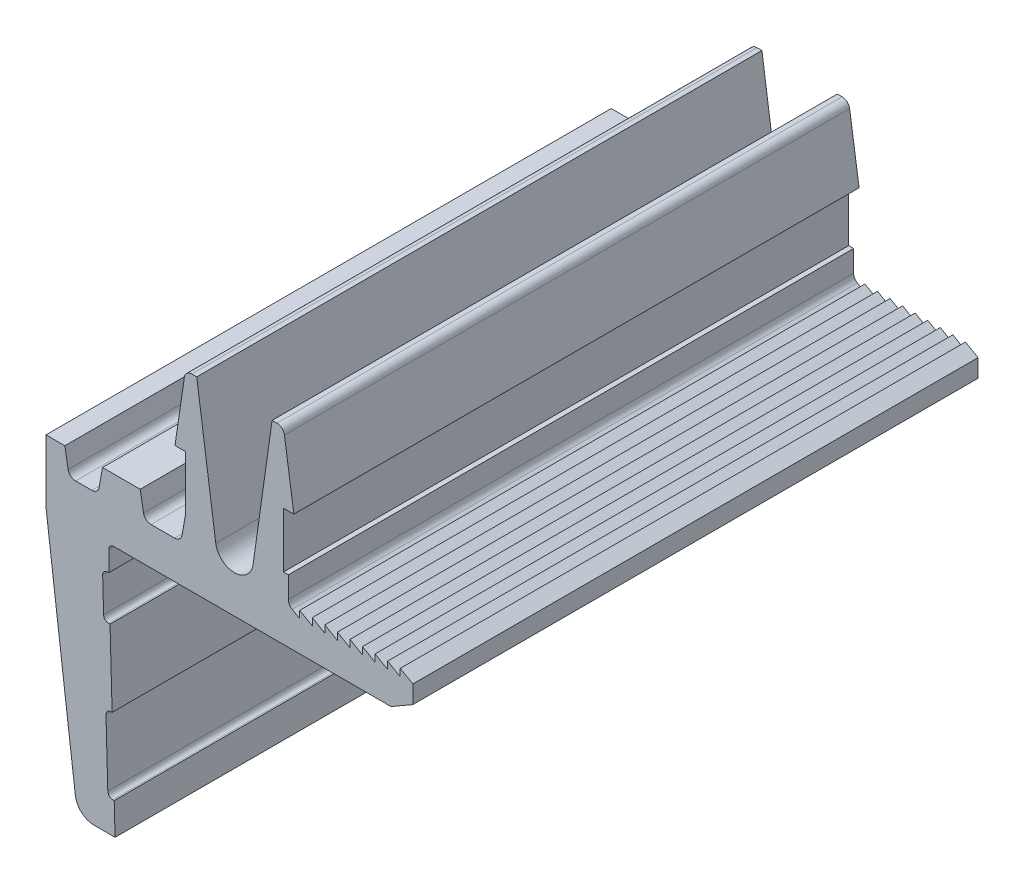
ISO-10303-21;
HEADER;
FILE_DESCRIPTION(('STEP AP214'),'2;1');
FILE_NAME('part.step','',(''),(''),'','','');
FILE_SCHEMA(('AUTOMOTIVE_DESIGN { 1 0 10303 214 1 1 1 1 }'));
ENDSEC;
DATA;
#1=APPLICATION_CONTEXT('core data for automotive mechanical design processes');
#2=APPLICATION_PROTOCOL_DEFINITION('international standard','automotive_design',2000,#1);
#3=PRODUCT_CONTEXT('',#1,'mechanical');
#4=PRODUCT('Part','Part','',(#3));
#5=PRODUCT_RELATED_PRODUCT_CATEGORY('part','',(#4));
#6=PRODUCT_DEFINITION_FORMATION('','',#4);
#7=PRODUCT_DEFINITION_CONTEXT('part definition',#1,'design');
#8=PRODUCT_DEFINITION('design','',#6,#7);
#9=PRODUCT_DEFINITION_SHAPE('','',#8);
#10=(LENGTH_UNIT() NAMED_UNIT(*) SI_UNIT(.MILLI.,.METRE.));
#11=(NAMED_UNIT(*) PLANE_ANGLE_UNIT() SI_UNIT($,.RADIAN.));
#12=(NAMED_UNIT(*) SI_UNIT($,.STERADIAN.) SOLID_ANGLE_UNIT());
#13=UNCERTAINTY_MEASURE_WITH_UNIT(LENGTH_MEASURE(1.E-05),#10,'distance_accuracy_value','');
#14=(GEOMETRIC_REPRESENTATION_CONTEXT(3) GLOBAL_UNCERTAINTY_ASSIGNED_CONTEXT((#13)) GLOBAL_UNIT_ASSIGNED_CONTEXT((#10,
#11,#12)) REPRESENTATION_CONTEXT('',''));
#15=CARTESIAN_POINT('',(0.,0.,0.));
#16=DIRECTION('',(0.,0.,1.));
#17=DIRECTION('',(1.,0.,0.));
#18=AXIS2_PLACEMENT_3D('',#15,#16,#17);
#19=CARTESIAN_POINT('',(8.19999694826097,-2.59651764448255,0.));
#20=DIRECTION('',(-1.,-7.240135E-12,0.));
#21=DIRECTION('',(7.240135E-12,-1.,0.));
#22=AXIS2_PLACEMENT_3D('',#19,#20,#21);
#23=PLANE('',#22);
#24=DIRECTION('',(7.240135E-12,-1.,0.));
#25=VECTOR('',#24,1.);
#26=CARTESIAN_POINT('',(8.19999694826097,-2.59651764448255,-22.5));
#27=LINE('',#26,#25);
#28=CARTESIAN_POINT('',(8.19999694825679,-2.01918180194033,-22.5));
#29=VERTEX_POINT('',#28);
#30=CARTESIAN_POINT('',(8.19999694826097,-2.59651764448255,-22.5));
#31=VERTEX_POINT('',#30);
#32=EDGE_CURVE('E601',#29,#31,#27,.T.);
#33=ORIENTED_EDGE('',*,*,#32,.T.);
#34=DIRECTION('',(0.,0.,1.));
#35=VECTOR('',#34,1.);
#36=CARTESIAN_POINT('',(8.19999694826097,-2.59651764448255,0.));
#37=LINE('',#36,#35);
#38=CARTESIAN_POINT('',(8.19999694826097,-2.59651764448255,22.5));
#39=VERTEX_POINT('',#38);
#40=EDGE_CURVE('E588',#39,#31,#37,.F.);
#41=ORIENTED_EDGE('',*,*,#40,.F.);
#42=DIRECTION('',(7.240135E-12,-1.,0.));
#43=VECTOR('',#42,1.);
#44=CARTESIAN_POINT('',(8.19999694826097,-2.59651764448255,22.5));
#45=LINE('',#44,#43);
#46=CARTESIAN_POINT('',(8.19999694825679,-2.01918180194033,22.5));
#47=VERTEX_POINT('',#46);
#48=EDGE_CURVE('E605',#39,#47,#45,.F.);
#49=ORIENTED_EDGE('',*,*,#48,.T.);
#50=DIRECTION('',(0.,0.,1.));
#51=VECTOR('',#50,1.);
#52=CARTESIAN_POINT('',(8.19999694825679,-2.01918180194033,0.));
#53=LINE('',#52,#51);
#54=EDGE_CURVE('E592',#29,#47,#53,.T.);
#55=ORIENTED_EDGE('',*,*,#54,.F.);
#56=EDGE_LOOP('',(#33,#41,#49,#55));
#57=FACE_BOUND('',#56,.T.);
#58=ADVANCED_FACE('F15',(#57),#23,.T.);
#59=CARTESIAN_POINT('',(8.19999694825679,-2.01918180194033,0.));
#60=DIRECTION('',(0.499990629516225,0.866030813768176,0.));
#61=DIRECTION('',(-0.866030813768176,0.499990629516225,0.));
#62=AXIS2_PLACEMENT_3D('',#59,#60,#61);
#63=PLANE('',#62);
#64=DIRECTION('',(-0.866030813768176,0.499990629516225,0.));
#65=VECTOR('',#64,1.);
#66=CARTESIAN_POINT('',(8.19999694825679,-2.01918180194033,-22.5));
#67=LINE('',#66,#65);
#68=CARTESIAN_POINT('',(9.19999694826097,-2.59651764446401,-22.5));
#69=VERTEX_POINT('',#68);
#70=EDGE_CURVE('E595',#69,#29,#67,.T.);
#71=ORIENTED_EDGE('',*,*,#70,.T.);
#72=ORIENTED_EDGE('',*,*,#54,.T.);
#73=DIRECTION('',(-0.866030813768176,0.499990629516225,0.));
#74=VECTOR('',#73,1.);
#75=CARTESIAN_POINT('',(8.19999694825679,-2.01918180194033,22.5));
#76=LINE('',#75,#74);
#77=CARTESIAN_POINT('',(9.19999694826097,-2.59651764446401,22.5));
#78=VERTEX_POINT('',#77);
#79=EDGE_CURVE('E598',#47,#78,#76,.F.);
#80=ORIENTED_EDGE('',*,*,#79,.T.);
#81=DIRECTION('',(0.,0.,1.));
#82=VECTOR('',#81,1.);
#83=CARTESIAN_POINT('',(9.19999694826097,-2.59651764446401,0.));
#84=LINE('',#83,#82);
#85=EDGE_CURVE('E575',#69,#78,#84,.T.);
#86=ORIENTED_EDGE('',*,*,#85,.F.);
#87=EDGE_LOOP('',(#71,#72,#80,#86));
#88=FACE_BOUND('',#87,.T.);
#89=ADVANCED_FACE('F1567',(#88),#63,.T.);
#90=CARTESIAN_POINT('',(7.19999694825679,-2.01918180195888,0.));
#91=DIRECTION('',(0.499990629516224,0.866030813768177,0.));
#92=DIRECTION('',(-0.866030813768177,0.499990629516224,0.));
#93=AXIS2_PLACEMENT_3D('',#90,#91,#92);
#94=PLANE('',#93);
#95=DIRECTION('',(-0.866030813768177,0.499990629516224,0.));
#96=VECTOR('',#95,1.);
#97=CARTESIAN_POINT('',(7.19999694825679,-2.01918180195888,-22.5));
#98=LINE('',#97,#96);
#99=CARTESIAN_POINT('',(7.19999694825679,-2.01918180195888,-22.5));
#100=VERTEX_POINT('',#99);
#101=EDGE_CURVE('E584',#31,#100,#98,.T.);
#102=ORIENTED_EDGE('',*,*,#101,.T.);
#103=DIRECTION('',(0.,0.,1.));
#104=VECTOR('',#103,1.);
#105=CARTESIAN_POINT('',(7.19999694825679,-2.01918180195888,0.));
#106=LINE('',#105,#104);
#107=CARTESIAN_POINT('',(7.19999694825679,-2.01918180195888,22.5));
#108=VERTEX_POINT('',#107);
#109=EDGE_CURVE('E571',#108,#100,#106,.F.);
#110=ORIENTED_EDGE('',*,*,#109,.F.);
#111=DIRECTION('',(-0.866030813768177,0.499990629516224,0.));
#112=VECTOR('',#111,1.);
#113=CARTESIAN_POINT('',(7.19999694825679,-2.01918180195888,22.5));
#114=LINE('',#113,#112);
#115=EDGE_CURVE('E589',#108,#39,#114,.F.);
#116=ORIENTED_EDGE('',*,*,#115,.T.);
#117=ORIENTED_EDGE('',*,*,#40,.T.);
#118=EDGE_LOOP('',(#102,#110,#116,#117));
#119=FACE_BOUND('',#118,.T.);
#120=ADVANCED_FACE('F1559',(#119),#94,.T.);
#121=CARTESIAN_POINT('',(9.19999694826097,-2.59651764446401,0.));
#122=DIRECTION('',(-1.,-7.240135E-12,0.));
#123=DIRECTION('',(7.240135E-12,-1.,0.));
#124=AXIS2_PLACEMENT_3D('',#121,#122,#123);
#125=PLANE('',#124);
#126=DIRECTION('',(7.240135E-12,-1.,0.));
#127=VECTOR('',#126,1.);
#128=CARTESIAN_POINT('',(9.19999694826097,-2.59651764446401,-22.5));
#129=LINE('',#128,#127);
#130=CARTESIAN_POINT('',(9.19999694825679,-2.01918180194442,-22.5));
#131=VERTEX_POINT('',#130);
#132=EDGE_CURVE('E578',#131,#69,#129,.T.);
#133=ORIENTED_EDGE('',*,*,#132,.T.);
#134=ORIENTED_EDGE('',*,*,#85,.T.);
#135=DIRECTION('',(7.240135E-12,-1.,0.));
#136=VECTOR('',#135,1.);
#137=CARTESIAN_POINT('',(9.19999694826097,-2.59651764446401,22.5));
#138=LINE('',#137,#136);
#139=CARTESIAN_POINT('',(9.19999694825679,-2.01918180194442,22.5));
#140=VERTEX_POINT('',#139);
#141=EDGE_CURVE('E581',#78,#140,#138,.F.);
#142=ORIENTED_EDGE('',*,*,#141,.T.);
#143=DIRECTION('',(0.,0.,1.));
#144=VECTOR('',#143,1.);
#145=CARTESIAN_POINT('',(9.19999694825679,-2.01918180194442,0.));
#146=LINE('',#145,#144);
#147=EDGE_CURVE('E558',#131,#140,#146,.T.);
#148=ORIENTED_EDGE('',*,*,#147,.F.);
#149=EDGE_LOOP('',(#133,#134,#142,#148));
#150=FACE_BOUND('',#149,.T.);
#151=ADVANCED_FACE('F1551',(#150),#125,.T.);
#152=CARTESIAN_POINT('',(7.19999694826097,-2.59651764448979,0.));
#153=DIRECTION('',(-1.,-7.240135E-12,0.));
#154=DIRECTION('',(7.240135E-12,-1.,0.));
#155=AXIS2_PLACEMENT_3D('',#152,#153,#154);
#156=PLANE('',#155);
#157=DIRECTION('',(7.240135E-12,-1.,0.));
#158=VECTOR('',#157,1.);
#159=CARTESIAN_POINT('',(7.19999694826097,-2.59651764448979,-22.5));
#160=LINE('',#159,#158);
#161=CARTESIAN_POINT('',(7.19999694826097,-2.59651764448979,-22.5));
#162=VERTEX_POINT('',#161);
#163=EDGE_CURVE('E567',#100,#162,#160,.T.);
#164=ORIENTED_EDGE('',*,*,#163,.T.);
#165=DIRECTION('',(0.,0.,1.));
#166=VECTOR('',#165,1.);
#167=CARTESIAN_POINT('',(7.19999694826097,-2.59651764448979,0.));
#168=LINE('',#167,#166);
#169=CARTESIAN_POINT('',(7.19999694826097,-2.59651764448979,22.5));
#170=VERTEX_POINT('',#169);
#171=EDGE_CURVE('E554',#170,#162,#168,.F.);
#172=ORIENTED_EDGE('',*,*,#171,.F.);
#173=DIRECTION('',(7.240135E-12,-1.,0.));
#174=VECTOR('',#173,1.);
#175=CARTESIAN_POINT('',(7.19999694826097,-2.59651764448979,22.5));
#176=LINE('',#175,#174);
#177=EDGE_CURVE('E572',#170,#108,#176,.F.);
#178=ORIENTED_EDGE('',*,*,#177,.T.);
#179=ORIENTED_EDGE('',*,*,#109,.T.);
#180=EDGE_LOOP('',(#164,#172,#178,#179));
#181=FACE_BOUND('',#180,.T.);
#182=ADVANCED_FACE('F1543',(#181),#156,.T.);
#183=CARTESIAN_POINT('',(9.19999694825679,-2.01918180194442,0.));
#184=DIRECTION('',(0.499990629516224,0.866030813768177,0.));
#185=DIRECTION('',(-0.866030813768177,0.499990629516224,0.));
#186=AXIS2_PLACEMENT_3D('',#183,#184,#185);
#187=PLANE('',#186);
#188=DIRECTION('',(-0.866030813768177,0.499990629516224,0.));
#189=VECTOR('',#188,1.);
#190=CARTESIAN_POINT('',(9.19999694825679,-2.01918180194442,-22.5));
#191=LINE('',#190,#189);
#192=CARTESIAN_POINT('',(10.199996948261,-2.59651764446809,-22.5));
#193=VERTEX_POINT('',#192);
#194=EDGE_CURVE('E561',#193,#131,#191,.T.);
#195=ORIENTED_EDGE('',*,*,#194,.T.);
#196=ORIENTED_EDGE('',*,*,#147,.T.);
#197=DIRECTION('',(-0.866030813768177,0.499990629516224,0.));
#198=VECTOR('',#197,1.);
#199=CARTESIAN_POINT('',(9.19999694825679,-2.01918180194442,22.5));
#200=LINE('',#199,#198);
#201=CARTESIAN_POINT('',(10.199996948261,-2.59651764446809,22.5));
#202=VERTEX_POINT('',#201);
#203=EDGE_CURVE('E564',#140,#202,#200,.F.);
#204=ORIENTED_EDGE('',*,*,#203,.T.);
#205=DIRECTION('',(0.,0.,1.));
#206=VECTOR('',#205,1.);
#207=CARTESIAN_POINT('',(10.199996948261,-2.59651764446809,0.));
#208=LINE('',#207,#206);
#209=EDGE_CURVE('E541',#193,#202,#208,.T.);
#210=ORIENTED_EDGE('',*,*,#209,.F.);
#211=EDGE_LOOP('',(#195,#196,#204,#210));
#212=FACE_BOUND('',#211,.T.);
#213=ADVANCED_FACE('F1535',(#212),#187,.T.);
#214=CARTESIAN_POINT('',(6.19999694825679,-2.01918180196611,0.));
#215=DIRECTION('',(0.499990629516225,0.866030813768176,0.));
#216=DIRECTION('',(-0.866030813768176,0.499990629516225,0.));
#217=AXIS2_PLACEMENT_3D('',#214,#215,#216);
#218=PLANE('',#217);
#219=DIRECTION('',(-0.866030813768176,0.499990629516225,0.));
#220=VECTOR('',#219,1.);
#221=CARTESIAN_POINT('',(6.19999694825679,-2.01918180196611,-22.5));
#222=LINE('',#221,#220);
#223=CARTESIAN_POINT('',(6.19999694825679,-2.01918180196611,-22.5));
#224=VERTEX_POINT('',#223);
#225=EDGE_CURVE('E550',#162,#224,#222,.T.);
#226=ORIENTED_EDGE('',*,*,#225,.T.);
#227=DIRECTION('',(0.,0.,1.));
#228=VECTOR('',#227,1.);
#229=CARTESIAN_POINT('',(6.19999694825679,-2.01918180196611,0.));
#230=LINE('',#229,#228);
#231=CARTESIAN_POINT('',(6.19999694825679,-2.01918180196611,22.5));
#232=VERTEX_POINT('',#231);
#233=EDGE_CURVE('E537',#232,#224,#230,.F.);
#234=ORIENTED_EDGE('',*,*,#233,.F.);
#235=DIRECTION('',(-0.866030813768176,0.499990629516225,0.));
#236=VECTOR('',#235,1.);
#237=CARTESIAN_POINT('',(6.19999694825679,-2.01918180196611,22.5));
#238=LINE('',#237,#236);
#239=EDGE_CURVE('E555',#232,#170,#238,.F.);
#240=ORIENTED_EDGE('',*,*,#239,.T.);
#241=ORIENTED_EDGE('',*,*,#171,.T.);
#242=EDGE_LOOP('',(#226,#234,#240,#241));
#243=FACE_BOUND('',#242,.T.);
#244=ADVANCED_FACE('F1527',(#243),#218,.T.);
#245=CARTESIAN_POINT('',(10.199996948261,-2.59651764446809,0.));
#246=DIRECTION('',(-1.,-7.238212E-12,0.));
#247=DIRECTION('',(7.238212E-12,-1.,0.));
#248=AXIS2_PLACEMENT_3D('',#245,#246,#247);
#249=PLANE('',#248);
#250=DIRECTION('',(7.238212E-12,-1.,0.));
#251=VECTOR('',#250,1.);
#252=CARTESIAN_POINT('',(10.199996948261,-2.59651764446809,-22.5));
#253=LINE('',#252,#251);
#254=CARTESIAN_POINT('',(10.1999969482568,-2.01918180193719,-22.5));
#255=VERTEX_POINT('',#254);
#256=EDGE_CURVE('E544',#255,#193,#253,.T.);
#257=ORIENTED_EDGE('',*,*,#256,.T.);
#258=ORIENTED_EDGE('',*,*,#209,.T.);
#259=DIRECTION('',(7.238212E-12,-1.,0.));
#260=VECTOR('',#259,1.);
#261=CARTESIAN_POINT('',(10.199996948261,-2.59651764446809,22.5));
#262=LINE('',#261,#260);
#263=CARTESIAN_POINT('',(10.1999969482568,-2.01918180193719,22.5));
#264=VERTEX_POINT('',#263);
#265=EDGE_CURVE('E547',#202,#264,#262,.F.);
#266=ORIENTED_EDGE('',*,*,#265,.T.);
#267=DIRECTION('',(0.,0.,1.));
#268=VECTOR('',#267,1.);
#269=CARTESIAN_POINT('',(10.1999969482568,-2.01918180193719,0.));
#270=LINE('',#269,#268);
#271=EDGE_CURVE('E524',#255,#264,#270,.T.);
#272=ORIENTED_EDGE('',*,*,#271,.F.);
#273=EDGE_LOOP('',(#257,#258,#266,#272));
#274=FACE_BOUND('',#273,.T.);
#275=ADVANCED_FACE('F1519',(#274),#249,.T.);
#276=CARTESIAN_POINT('',(6.19999694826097,-2.59651764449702,0.));
#277=DIRECTION('',(-1.,-7.240135E-12,0.));
#278=DIRECTION('',(7.240135E-12,-1.,0.));
#279=AXIS2_PLACEMENT_3D('',#276,#277,#278);
#280=PLANE('',#279);
#281=DIRECTION('',(7.240135E-12,-1.,0.));
#282=VECTOR('',#281,1.);
#283=CARTESIAN_POINT('',(6.19999694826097,-2.59651764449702,-22.5));
#284=LINE('',#283,#282);
#285=CARTESIAN_POINT('',(6.19999694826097,-2.59651764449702,-22.5));
#286=VERTEX_POINT('',#285);
#287=EDGE_CURVE('E533',#224,#286,#284,.T.);
#288=ORIENTED_EDGE('',*,*,#287,.T.);
#289=DIRECTION('',(0.,0.,1.));
#290=VECTOR('',#289,1.);
#291=CARTESIAN_POINT('',(6.19999694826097,-2.59651764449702,0.));
#292=LINE('',#291,#290);
#293=CARTESIAN_POINT('',(6.19999694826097,-2.59651764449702,22.5));
#294=VERTEX_POINT('',#293);
#295=EDGE_CURVE('E520',#294,#286,#292,.F.);
#296=ORIENTED_EDGE('',*,*,#295,.F.);
#297=DIRECTION('',(7.240135E-12,-1.,0.));
#298=VECTOR('',#297,1.);
#299=CARTESIAN_POINT('',(6.19999694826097,-2.59651764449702,22.5));
#300=LINE('',#299,#298);
#301=EDGE_CURVE('E538',#294,#232,#300,.F.);
#302=ORIENTED_EDGE('',*,*,#301,.T.);
#303=ORIENTED_EDGE('',*,*,#233,.T.);
#304=EDGE_LOOP('',(#288,#296,#302,#303));
#305=FACE_BOUND('',#304,.T.);
#306=ADVANCED_FACE('F1511',(#305),#280,.T.);
#307=CARTESIAN_POINT('',(10.1999969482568,-2.01918180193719,0.));
#308=DIRECTION('',(0.499990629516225,0.866030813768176,0.));
#309=DIRECTION('',(-0.866030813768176,0.499990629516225,0.));
#310=AXIS2_PLACEMENT_3D('',#307,#308,#309);
#311=PLANE('',#310);
#312=DIRECTION('',(-0.866030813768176,0.499990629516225,0.));
#313=VECTOR('',#312,1.);
#314=CARTESIAN_POINT('',(10.1999969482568,-2.01918180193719,-22.5));
#315=LINE('',#314,#313);
#316=CARTESIAN_POINT('',(11.199996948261,-2.59651764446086,-22.5));
#317=VERTEX_POINT('',#316);
#318=EDGE_CURVE('E527',#317,#255,#315,.T.);
#319=ORIENTED_EDGE('',*,*,#318,.T.);
#320=ORIENTED_EDGE('',*,*,#271,.T.);
#321=DIRECTION('',(-0.866030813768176,0.499990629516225,0.));
#322=VECTOR('',#321,1.);
#323=CARTESIAN_POINT('',(10.1999969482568,-2.01918180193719,22.5));
#324=LINE('',#323,#322);
#325=CARTESIAN_POINT('',(11.199996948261,-2.59651764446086,22.5));
#326=VERTEX_POINT('',#325);
#327=EDGE_CURVE('E530',#264,#326,#324,.F.);
#328=ORIENTED_EDGE('',*,*,#327,.T.);
#329=DIRECTION('',(0.,0.,1.));
#330=VECTOR('',#329,1.);
#331=CARTESIAN_POINT('',(11.199996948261,-2.59651764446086,0.));
#332=LINE('',#331,#330);
#333=EDGE_CURVE('E507',#317,#326,#332,.T.);
#334=ORIENTED_EDGE('',*,*,#333,.F.);
#335=EDGE_LOOP('',(#319,#320,#328,#334));
#336=FACE_BOUND('',#335,.T.);
#337=ADVANCED_FACE('F1503',(#336),#311,.T.);
#338=CARTESIAN_POINT('',(5.19999694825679,-2.01918180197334,0.));
#339=DIRECTION('',(0.499990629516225,0.866030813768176,0.));
#340=DIRECTION('',(-0.866030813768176,0.499990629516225,0.));
#341=AXIS2_PLACEMENT_3D('',#338,#339,#340);
#342=PLANE('',#341);
#343=DIRECTION('',(-0.866030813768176,0.499990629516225,0.));
#344=VECTOR('',#343,1.);
#345=CARTESIAN_POINT('',(5.19999694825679,-2.01918180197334,-22.5));
#346=LINE('',#345,#344);
#347=CARTESIAN_POINT('',(5.19999694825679,-2.01918180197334,-22.5));
#348=VERTEX_POINT('',#347);
#349=EDGE_CURVE('E516',#286,#348,#346,.T.);
#350=ORIENTED_EDGE('',*,*,#349,.T.);
#351=DIRECTION('',(0.,0.,1.));
#352=VECTOR('',#351,1.);
#353=CARTESIAN_POINT('',(5.19999694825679,-2.01918180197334,0.));
#354=LINE('',#353,#352);
#355=CARTESIAN_POINT('',(5.19999694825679,-2.01918180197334,22.5));
#356=VERTEX_POINT('',#355);
#357=EDGE_CURVE('E503',#356,#348,#354,.F.);
#358=ORIENTED_EDGE('',*,*,#357,.F.);
#359=DIRECTION('',(-0.866030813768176,0.499990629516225,0.));
#360=VECTOR('',#359,1.);
#361=CARTESIAN_POINT('',(5.19999694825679,-2.01918180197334,22.5));
#362=LINE('',#361,#360);
#363=EDGE_CURVE('E521',#356,#294,#362,.F.);
#364=ORIENTED_EDGE('',*,*,#363,.T.);
#365=ORIENTED_EDGE('',*,*,#295,.T.);
#366=EDGE_LOOP('',(#350,#358,#364,#365));
#367=FACE_BOUND('',#366,.T.);
#368=ADVANCED_FACE('F1495',(#367),#342,.T.);
#369=CARTESIAN_POINT('',(11.199996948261,-2.59651764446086,0.));
#370=DIRECTION('',(-1.,-7.23052E-12,0.));
#371=DIRECTION('',(7.23052E-12,-1.,0.));
#372=AXIS2_PLACEMENT_3D('',#369,#370,#371);
#373=PLANE('',#372);
#374=DIRECTION('',(7.23052E-12,-1.,0.));
#375=VECTOR('',#374,1.);
#376=CARTESIAN_POINT('',(11.199996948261,-2.59651764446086,-22.5));
#377=LINE('',#376,#375);
#378=CARTESIAN_POINT('',(11.1999969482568,-2.01918180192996,-22.5));
#379=VERTEX_POINT('',#378);
#380=EDGE_CURVE('E510',#379,#317,#377,.T.);
#381=ORIENTED_EDGE('',*,*,#380,.T.);
#382=ORIENTED_EDGE('',*,*,#333,.T.);
#383=DIRECTION('',(7.23052E-12,-1.,0.));
#384=VECTOR('',#383,1.);
#385=CARTESIAN_POINT('',(11.199996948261,-2.59651764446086,22.5));
#386=LINE('',#385,#384);
#387=CARTESIAN_POINT('',(11.1999969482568,-2.01918180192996,22.5));
#388=VERTEX_POINT('',#387);
#389=EDGE_CURVE('E513',#326,#388,#386,.F.);
#390=ORIENTED_EDGE('',*,*,#389,.T.);
#391=DIRECTION('',(0.,0.,1.));
#392=VECTOR('',#391,1.);
#393=CARTESIAN_POINT('',(11.1999969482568,-2.01918180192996,0.));
#394=LINE('',#393,#392);
#395=EDGE_CURVE('E488',#379,#388,#394,.T.);
#396=ORIENTED_EDGE('',*,*,#395,.F.);
#397=EDGE_LOOP('',(#381,#382,#390,#396));
#398=FACE_BOUND('',#397,.T.);
#399=ADVANCED_FACE('F1487',(#398),#373,.T.);
#400=CARTESIAN_POINT('',(5.19999694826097,-2.59652860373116,0.));
#401=DIRECTION('',(-1.,-7.232306E-12,0.));
#402=DIRECTION('',(7.232306E-12,-1.,0.));
#403=AXIS2_PLACEMENT_3D('',#400,#401,#402);
#404=PLANE('',#403);
#405=DIRECTION('',(7.232306E-12,-1.,0.));
#406=VECTOR('',#405,1.);
#407=CARTESIAN_POINT('',(5.19999694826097,-2.59652860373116,-22.5));
#408=LINE('',#407,#406);
#409=CARTESIAN_POINT('',(5.19999694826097,-2.59652860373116,-22.5));
#410=VERTEX_POINT('',#409);
#411=EDGE_CURVE('E499',#348,#410,#408,.T.);
#412=ORIENTED_EDGE('',*,*,#411,.T.);
#413=DIRECTION('',(0.,0.,1.));
#414=VECTOR('',#413,1.);
#415=CARTESIAN_POINT('',(5.19999694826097,-2.59652860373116,0.));
#416=LINE('',#415,#414);
#417=CARTESIAN_POINT('',(5.19999694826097,-2.59652860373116,22.5));
#418=VERTEX_POINT('',#417);
#419=EDGE_CURVE('E487',#418,#410,#416,.F.);
#420=ORIENTED_EDGE('',*,*,#419,.F.);
#421=DIRECTION('',(7.232306E-12,-1.,0.));
#422=VECTOR('',#421,1.);
#423=CARTESIAN_POINT('',(5.19999694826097,-2.59652860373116,22.5));
#424=LINE('',#423,#422);
#425=EDGE_CURVE('E504',#418,#356,#424,.F.);
#426=ORIENTED_EDGE('',*,*,#425,.T.);
#427=ORIENTED_EDGE('',*,*,#357,.T.);
#428=EDGE_LOOP('',(#412,#420,#426,#427));
#429=FACE_BOUND('',#428,.T.);
#430=ADVANCED_FACE('F1479',(#429),#404,.T.);
#431=CARTESIAN_POINT('',(11.1999969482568,-2.01918180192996,0.));
#432=DIRECTION('',(0.499990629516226,0.866030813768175,0.));
#433=DIRECTION('',(-0.866030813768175,0.499990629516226,0.));
#434=AXIS2_PLACEMENT_3D('',#431,#432,#433);
#435=PLANE('',#434);
#436=DIRECTION('',(-0.866030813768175,0.499990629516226,0.));
#437=VECTOR('',#436,1.);
#438=CARTESIAN_POINT('',(11.1999969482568,-2.01918180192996,-22.5));
#439=LINE('',#438,#437);
#440=CARTESIAN_POINT('',(12.199996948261,-2.59651764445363,-22.5));
#441=VERTEX_POINT('',#440);
#442=EDGE_CURVE('E493',#441,#379,#439,.T.);
#443=ORIENTED_EDGE('',*,*,#442,.T.);
#444=ORIENTED_EDGE('',*,*,#395,.T.);
#445=DIRECTION('',(-0.866030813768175,0.499990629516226,0.));
#446=VECTOR('',#445,1.);
#447=CARTESIAN_POINT('',(11.1999969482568,-2.01918180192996,22.5));
#448=LINE('',#447,#446);
#449=CARTESIAN_POINT('',(12.199996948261,-2.59651764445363,22.5));
#450=VERTEX_POINT('',#449);
#451=EDGE_CURVE('E496',#388,#450,#448,.F.);
#452=ORIENTED_EDGE('',*,*,#451,.T.);
#453=DIRECTION('',(0.,0.,1.));
#454=VECTOR('',#453,1.);
#455=CARTESIAN_POINT('',(12.199996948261,-2.59651764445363,0.));
#456=LINE('',#455,#454);
#457=EDGE_CURVE('E446',#441,#450,#456,.T.);
#458=ORIENTED_EDGE('',*,*,#457,.F.);
#459=EDGE_LOOP('',(#443,#444,#452,#458));
#460=FACE_BOUND('',#459,.T.);
#461=ADVANCED_FACE('F1471',(#460),#435,.T.);
#462=CARTESIAN_POINT('',(4.59999502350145,-2.25012598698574,0.));
#463=DIRECTION('',(0.499990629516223,0.866030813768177,0.));
#464=DIRECTION('',(-0.866030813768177,0.499990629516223,0.));
#465=AXIS2_PLACEMENT_3D('',#462,#463,#464);
#466=PLANE('',#465);
#467=DIRECTION('',(-0.866030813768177,0.499990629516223,0.));
#468=VECTOR('',#467,1.);
#469=CARTESIAN_POINT('',(4.59999502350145,-2.25012598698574,-22.5));
#470=LINE('',#469,#468);
#471=CARTESIAN_POINT('',(4.59999502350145,-2.25012598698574,-22.5));
#472=VERTEX_POINT('',#471);
#473=EDGE_CURVE('E475',#410,#472,#470,.T.);
#474=ORIENTED_EDGE('',*,*,#473,.T.);
#475=DIRECTION('',(0.,0.,1.));
#476=VECTOR('',#475,1.);
#477=CARTESIAN_POINT('',(4.59999502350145,-2.25012598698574,0.));
#478=LINE('',#477,#476);
#479=CARTESIAN_POINT('',(4.59999502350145,-2.25012598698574,22.5));
#480=VERTEX_POINT('',#479);
#481=EDGE_CURVE('E479',#472,#480,#478,.T.);
#482=ORIENTED_EDGE('',*,*,#481,.T.);
#483=DIRECTION('',(-0.866030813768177,0.499990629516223,0.));
#484=VECTOR('',#483,1.);
#485=CARTESIAN_POINT('',(4.59999502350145,-2.25012598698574,22.5));
#486=LINE('',#485,#484);
#487=EDGE_CURVE('E484',#480,#418,#486,.F.);
#488=ORIENTED_EDGE('',*,*,#487,.T.);
#489=ORIENTED_EDGE('',*,*,#419,.T.);
#490=EDGE_LOOP('',(#474,#482,#488,#489));
#491=FACE_BOUND('',#490,.T.);
#492=ADVANCED_FACE('F1463',(#491),#466,.T.);
#493=CARTESIAN_POINT('',(12.199996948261,-2.59651764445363,0.));
#494=DIRECTION('',(-1.,-7.238212E-12,0.));
#495=DIRECTION('',(7.238212E-12,-1.,0.));
#496=AXIS2_PLACEMENT_3D('',#493,#494,#495);
#497=PLANE('',#496);
#498=DIRECTION('',(7.238212E-12,-1.,0.));
#499=VECTOR('',#498,1.);
#500=CARTESIAN_POINT('',(12.199996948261,-2.59651764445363,-22.5));
#501=LINE('',#500,#499);
#502=CARTESIAN_POINT('',(12.1999969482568,-2.01918180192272,-22.5));
#503=VERTEX_POINT('',#502);
#504=EDGE_CURVE('E469',#503,#441,#501,.T.);
#505=ORIENTED_EDGE('',*,*,#504,.T.);
#506=ORIENTED_EDGE('',*,*,#457,.T.);
#507=DIRECTION('',(7.238212E-12,-1.,0.));
#508=VECTOR('',#507,1.);
#509=CARTESIAN_POINT('',(12.199996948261,-2.59651764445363,22.5));
#510=LINE('',#509,#508);
#511=CARTESIAN_POINT('',(12.1999969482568,-2.01918180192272,22.5));
#512=VERTEX_POINT('',#511);
#513=EDGE_CURVE('E472',#450,#512,#510,.F.);
#514=ORIENTED_EDGE('',*,*,#513,.T.);
#515=DIRECTION('',(0.,0.,1.));
#516=VECTOR('',#515,1.);
#517=CARTESIAN_POINT('',(12.1999969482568,-2.01918180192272,0.));
#518=LINE('',#517,#516);
#519=EDGE_CURVE('E460',#503,#512,#518,.T.);
#520=ORIENTED_EDGE('',*,*,#519,.F.);
#521=EDGE_LOOP('',(#505,#506,#514,#520));
#522=FACE_BOUND('',#521,.T.);
#523=ADVANCED_FACE('F1456',(#522),#497,.T.);
#524=CARTESIAN_POINT('',(-12.6439036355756,-1.4192091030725,0.));
#525=DIRECTION('',(0.,0.,1.));
#526=DIRECTION('',(1.,0.,0.));
#527=AXIS2_PLACEMENT_3D('',#524,#525,#526);
#528=CYLINDRICAL_SURFACE('',#527,0.599972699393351);
#529=DIRECTION('',(0.,0.,1.));
#530=VECTOR('',#529,1.);
#531=CARTESIAN_POINT('',(-12.6439036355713,-2.01918180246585,0.));
#532=LINE('',#531,#530);
#533=CARTESIAN_POINT('',(-12.6439036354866,-2.01918180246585,-22.5));
#534=VERTEX_POINT('',#533);
#535=CARTESIAN_POINT('',(-12.6439036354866,-2.01918180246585,22.5));
#536=VERTEX_POINT('',#535);
#537=EDGE_CURVE('E443',#534,#536,#532,.T.);
#538=ORIENTED_EDGE('',*,*,#537,.F.);
#539=CARTESIAN_POINT('',(-12.6439036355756,-1.4192091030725,-22.5));
#540=DIRECTION('',(0.,0.,1.));
#541=DIRECTION('',(1.,0.,0.));
#542=AXIS2_PLACEMENT_3D('',#539,#540,#541);
#543=CIRCLE('',#542,0.599972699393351);
#544=CARTESIAN_POINT('',(-13.2347615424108,-1.52339247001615,-22.5));
#545=VERTEX_POINT('',#544);
#546=EDGE_CURVE('E18',#545,#534,#543,.T.);
#547=ORIENTED_EDGE('',*,*,#546,.F.);
#548=DIRECTION('',(0.,0.,1.));
#549=VECTOR('',#548,1.);
#550=CARTESIAN_POINT('',(-13.2347615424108,-1.52339247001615,0.));
#551=LINE('',#550,#549);
#552=CARTESIAN_POINT('',(-13.2347615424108,-1.52339247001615,22.5));
#553=VERTEX_POINT('',#552);
#554=EDGE_CURVE('E440',#553,#545,#551,.F.);
#555=ORIENTED_EDGE('',*,*,#554,.F.);
#556=CARTESIAN_POINT('',(-12.6439036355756,-1.4192091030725,22.5));
#557=DIRECTION('',(0.,0.,1.));
#558=DIRECTION('',(1.,0.,0.));
#559=AXIS2_PLACEMENT_3D('',#556,#557,#558);
#560=CIRCLE('',#559,0.599972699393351);
#561=EDGE_CURVE('E445',#536,#553,#560,.F.);
#562=ORIENTED_EDGE('',*,*,#561,.F.);
#563=EDGE_LOOP('',(#538,#547,#555,#562));
#564=FACE_BOUND('',#563,.T.);
#565=ADVANCED_FACE('F437',(#564),#528,.F.);
#566=CARTESIAN_POINT('',(4.89997575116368,-1.73053114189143,0.));
#567=DIRECTION('',(0.,0.,1.));
#568=DIRECTION('',(1.,0.,0.));
#569=AXIS2_PLACEMENT_3D('',#566,#567,#568);
#570=CYLINDRICAL_SURFACE('',#569,0.599972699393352);
#571=ORIENTED_EDGE('',*,*,#481,.F.);
#572=CARTESIAN_POINT('',(4.89997575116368,-1.73053114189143,-22.5));
#573=DIRECTION('',(0.,0.,1.));
#574=DIRECTION('',(1.,0.,0.));
#575=AXIS2_PLACEMENT_3D('',#572,#573,#574);
#576=CIRCLE('',#575,0.599972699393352);
#577=CARTESIAN_POINT('',(4.30000305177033,-1.73053114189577,-22.5));
#578=VERTEX_POINT('',#577);
#579=EDGE_CURVE('E483',#578,#472,#576,.T.);
#580=ORIENTED_EDGE('',*,*,#579,.F.);
#581=DIRECTION('',(0.,0.,1.));
#582=VECTOR('',#581,1.);
#583=CARTESIAN_POINT('',(4.30000305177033,-1.73053114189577,0.));
#584=LINE('',#583,#582);
#585=CARTESIAN_POINT('',(4.30000305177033,-1.73053114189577,22.5));
#586=VERTEX_POINT('',#585);
#587=EDGE_CURVE('E705',#586,#578,#584,.F.);
#588=ORIENTED_EDGE('',*,*,#587,.F.);
#589=CARTESIAN_POINT('',(4.89997575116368,-1.73053114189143,22.5));
#590=DIRECTION('',(0.,0.,1.));
#591=DIRECTION('',(1.,0.,0.));
#592=AXIS2_PLACEMENT_3D('',#589,#590,#591);
#593=CIRCLE('',#592,0.599972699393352);
#594=EDGE_CURVE('E482',#480,#586,#593,.F.);
#595=ORIENTED_EDGE('',*,*,#594,.F.);
#596=EDGE_LOOP('',(#571,#580,#588,#595));
#597=FACE_BOUND('',#596,.T.);
#598=ADVANCED_FACE('F728',(#597),#570,.F.);
#599=CARTESIAN_POINT('',(-12.6439036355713,-2.01918180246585,0.));
#600=DIRECTION('',(-2.894685E-10,1.,0.));
#601=DIRECTION('',(-1.,-2.894685E-10,0.));
#602=AXIS2_PLACEMENT_3D('',#599,#600,#601);
#603=PLANE('',#602);
#604=DIRECTION('',(-1.,-2.894685E-10,0.));
#605=VECTOR('',#604,1.);
#606=CARTESIAN_POINT('',(-12.6439036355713,-2.01918180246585,-22.5));
#607=LINE('',#606,#605);
#608=CARTESIAN_POINT('',(-11.3560811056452,-2.01918180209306,-22.5));
#609=VERTEX_POINT('',#608);
#610=EDGE_CURVE('E478',#609,#534,#607,.T.);
#611=ORIENTED_EDGE('',*,*,#610,.T.);
#612=ORIENTED_EDGE('',*,*,#537,.T.);
#613=DIRECTION('',(-1.,-2.894685E-10,0.));
#614=VECTOR('',#613,1.);
#615=CARTESIAN_POINT('',(-12.6439036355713,-2.01918180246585,22.5));
#616=LINE('',#615,#614);
#617=CARTESIAN_POINT('',(-11.3560811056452,-2.01918180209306,22.5));
#618=VERTEX_POINT('',#617);
#619=EDGE_CURVE('E693',#536,#618,#616,.F.);
#620=ORIENTED_EDGE('',*,*,#619,.T.);
#621=DIRECTION('',(0.,0.,1.));
#622=VECTOR('',#621,1.);
#623=CARTESIAN_POINT('',(-11.3560811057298,-2.01918180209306,0.));
#624=LINE('',#623,#622);
#625=EDGE_CURVE('E691',#618,#609,#624,.F.);
#626=ORIENTED_EDGE('',*,*,#625,.T.);
#627=EDGE_LOOP('',(#611,#612,#620,#626));
#628=FACE_BOUND('',#627,.T.);
#629=ADVANCED_FACE('F697',(#628),#603,.T.);
#630=CARTESIAN_POINT('',(12.1999969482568,-2.01918180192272,0.));
#631=DIRECTION('',(0.499990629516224,0.866030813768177,0.));
#632=DIRECTION('',(-0.866030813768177,0.499990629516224,0.));
#633=AXIS2_PLACEMENT_3D('',#630,#631,#632);
#634=PLANE('',#633);
#635=DIRECTION('',(-0.866030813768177,0.499990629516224,0.));
#636=VECTOR('',#635,1.);
#637=CARTESIAN_POINT('',(12.1999969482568,-2.01918180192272,-22.5));
#638=LINE('',#637,#636);
#639=CARTESIAN_POINT('',(13.199996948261,-2.5965176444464,-22.5));
#640=VERTEX_POINT('',#639);
#641=EDGE_CURVE('E468',#640,#503,#638,.T.);
#642=ORIENTED_EDGE('',*,*,#641,.T.);
#643=ORIENTED_EDGE('',*,*,#519,.T.);
#644=DIRECTION('',(-0.866030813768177,0.499990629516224,0.));
#645=VECTOR('',#644,1.);
#646=CARTESIAN_POINT('',(12.1999969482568,-2.01918180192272,22.5));
#647=LINE('',#646,#645);
#648=CARTESIAN_POINT('',(13.199996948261,-2.5965176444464,22.5));
#649=VERTEX_POINT('',#648);
#650=EDGE_CURVE('E477',#512,#649,#647,.F.);
#651=ORIENTED_EDGE('',*,*,#650,.T.);
#652=DIRECTION('',(0.,0.,1.));
#653=VECTOR('',#652,1.);
#654=CARTESIAN_POINT('',(13.199996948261,-2.5965176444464,0.));
#655=LINE('',#654,#653);
#656=EDGE_CURVE('E813',#640,#649,#655,.T.);
#657=ORIENTED_EDGE('',*,*,#656,.F.);
#658=EDGE_LOOP('',(#642,#643,#651,#657));
#659=FACE_BOUND('',#658,.T.);
#660=ADVANCED_FACE('F823',(#659),#634,.T.);
#661=CARTESIAN_POINT('',(-13.4999923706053,-0.019181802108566,0.));
#662=DIRECTION('',(0.984807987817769,0.173646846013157,0.));
#663=DIRECTION('',(-0.173646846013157,0.984807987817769,0.));
#664=AXIS2_PLACEMENT_3D('',#661,#662,#663);
#665=PLANE('',#664);
#666=DIRECTION('',(-0.173646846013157,0.984807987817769,0.));
#667=VECTOR('',#666,1.);
#668=CARTESIAN_POINT('',(-13.4999923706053,-0.019181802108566,-22.5));
#669=LINE('',#668,#667);
#670=CARTESIAN_POINT('',(-13.4999923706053,-0.019181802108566,-22.5));
#671=VERTEX_POINT('',#670);
#672=EDGE_CURVE('E448',#545,#671,#669,.T.);
#673=ORIENTED_EDGE('',*,*,#672,.T.);
#674=DIRECTION('',(0.,0.,1.));
#675=VECTOR('',#674,1.);
#676=CARTESIAN_POINT('',(-13.4999923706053,-0.019181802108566,0.));
#677=LINE('',#676,#675);
#678=CARTESIAN_POINT('',(-13.4999923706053,-0.019181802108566,22.5));
#679=VERTEX_POINT('',#678);
#680=EDGE_CURVE('E810',#679,#671,#677,.F.);
#681=ORIENTED_EDGE('',*,*,#680,.F.);
#682=DIRECTION('',(-0.173646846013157,0.984807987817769,0.));
#683=VECTOR('',#682,1.);
#684=CARTESIAN_POINT('',(-13.4999923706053,-0.019181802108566,22.5));
#685=LINE('',#684,#683);
#686=EDGE_CURVE('E458',#679,#553,#685,.F.);
#687=ORIENTED_EDGE('',*,*,#686,.T.);
#688=ORIENTED_EDGE('',*,*,#554,.T.);
#689=EDGE_LOOP('',(#673,#681,#687,#688));
#690=FACE_BOUND('',#689,.T.);
#691=ADVANCED_FACE('F457',(#690),#665,.T.);
#692=CARTESIAN_POINT('',(4.30000305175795,-0.01918180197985,0.));
#693=DIRECTION('',(1.,7.230871E-12,0.));
#694=DIRECTION('',(-7.230871E-12,1.,0.));
#695=AXIS2_PLACEMENT_3D('',#692,#693,#694);
#696=PLANE('',#695);
#697=DIRECTION('',(-7.230871E-12,1.,0.));
#698=VECTOR('',#697,1.);
#699=CARTESIAN_POINT('',(4.30000305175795,-0.01918180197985,-22.5));
#700=LINE('',#699,#698);
#701=CARTESIAN_POINT('',(4.30000305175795,-0.01918180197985,-22.5));
#702=VERTEX_POINT('',#701);
#703=EDGE_CURVE('E708',#578,#702,#700,.T.);
#704=ORIENTED_EDGE('',*,*,#703,.T.);
#705=DIRECTION('',(0.,0.,1.));
#706=VECTOR('',#705,1.);
#707=CARTESIAN_POINT('',(4.30000305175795,-0.0191818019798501,0.));
#708=LINE('',#707,#706);
#709=CARTESIAN_POINT('',(4.30000305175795,-0.01918180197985,22.5));
#710=VERTEX_POINT('',#709);
#711=EDGE_CURVE('E714',#710,#702,#708,.F.);
#712=ORIENTED_EDGE('',*,*,#711,.F.);
#713=DIRECTION('',(-7.230871E-12,1.,0.));
#714=VECTOR('',#713,1.);
#715=CARTESIAN_POINT('',(4.30000305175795,-0.01918180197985,22.5));
#716=LINE('',#715,#714);
#717=EDGE_CURVE('E455',#710,#586,#716,.F.);
#718=ORIENTED_EDGE('',*,*,#717,.T.);
#719=ORIENTED_EDGE('',*,*,#587,.T.);
#720=EDGE_LOOP('',(#704,#712,#718,#719));
#721=FACE_BOUND('',#720,.T.);
#722=ADVANCED_FACE('F719',(#721),#696,.T.);
#723=CARTESIAN_POINT('',(-11.3560811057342,-1.41920910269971,0.));
#724=DIRECTION('',(0.,0.,1.));
#725=DIRECTION('',(1.,0.,0.));
#726=AXIS2_PLACEMENT_3D('',#723,#724,#725);
#727=CYLINDRICAL_SURFACE('',#726,0.599972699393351);
#728=DIRECTION('',(0.,0.,1.));
#729=VECTOR('',#728,1.);
#730=CARTESIAN_POINT('',(-10.7652231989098,-1.52339246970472,0.));
#731=LINE('',#730,#729);
#732=CARTESIAN_POINT('',(-10.7652231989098,-1.52339246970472,-22.5));
#733=VERTEX_POINT('',#732);
#734=CARTESIAN_POINT('',(-10.7652231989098,-1.52339246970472,22.5));
#735=VERTEX_POINT('',#734);
#736=EDGE_CURVE('E838',#733,#735,#731,.T.);
#737=ORIENTED_EDGE('',*,*,#736,.F.);
#738=CARTESIAN_POINT('',(-11.3560811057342,-1.41920910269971,-22.5));
#739=DIRECTION('',(0.,0.,1.));
#740=DIRECTION('',(1.,0.,0.));
#741=AXIS2_PLACEMENT_3D('',#738,#739,#740);
#742=CIRCLE('',#741,0.599972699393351);
#743=EDGE_CURVE('E689',#609,#733,#742,.T.);
#744=ORIENTED_EDGE('',*,*,#743,.F.);
#745=ORIENTED_EDGE('',*,*,#625,.F.);
#746=CARTESIAN_POINT('',(-11.3560811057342,-1.41920910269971,22.5));
#747=DIRECTION('',(0.,0.,1.));
#748=DIRECTION('',(1.,0.,0.));
#749=AXIS2_PLACEMENT_3D('',#746,#747,#748);
#750=CIRCLE('',#749,0.599972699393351);
#751=EDGE_CURVE('E685',#735,#618,#750,.F.);
#752=ORIENTED_EDGE('',*,*,#751,.F.);
#753=EDGE_LOOP('',(#737,#744,#745,#752));
#754=FACE_BOUND('',#753,.T.);
#755=ADVANCED_FACE('F1412',(#754),#727,.F.);
#756=CARTESIAN_POINT('',(13.199996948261,-2.5965176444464,0.));
#757=DIRECTION('',(-1.,-7.238212E-12,0.));
#758=DIRECTION('',(7.238212E-12,-1.,0.));
#759=AXIS2_PLACEMENT_3D('',#756,#757,#758);
#760=PLANE('',#759);
#761=DIRECTION('',(7.238212E-12,-1.,0.));
#762=VECTOR('',#761,1.);
#763=CARTESIAN_POINT('',(13.199996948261,-2.5965176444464,-22.5));
#764=LINE('',#763,#762);
#765=CARTESIAN_POINT('',(13.1999969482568,-2.01918180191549,-22.5));
#766=VERTEX_POINT('',#765);
#767=EDGE_CURVE('E817',#766,#640,#764,.T.);
#768=ORIENTED_EDGE('',*,*,#767,.T.);
#769=ORIENTED_EDGE('',*,*,#656,.T.);
#770=DIRECTION('',(7.238212E-12,-1.,0.));
#771=VECTOR('',#770,1.);
#772=CARTESIAN_POINT('',(13.199996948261,-2.5965176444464,22.5));
#773=LINE('',#772,#771);
#774=CARTESIAN_POINT('',(13.1999969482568,-2.01918180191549,22.5));
#775=VERTEX_POINT('',#774);
#776=EDGE_CURVE('E688',#649,#775,#773,.F.);
#777=ORIENTED_EDGE('',*,*,#776,.T.);
#778=DIRECTION('',(0.,0.,1.));
#779=VECTOR('',#778,1.);
#780=CARTESIAN_POINT('',(13.1999969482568,-2.01918180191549,0.));
#781=LINE('',#780,#779);
#782=EDGE_CURVE('E831',#766,#775,#781,.T.);
#783=ORIENTED_EDGE('',*,*,#782,.F.);
#784=EDGE_LOOP('',(#768,#769,#777,#783));
#785=FACE_BOUND('',#784,.T.);
#786=ADVANCED_FACE('F828',(#785),#760,.T.);
#787=CARTESIAN_POINT('',(-9.9999923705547,-7.01918180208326,0.));
#788=DIRECTION('',(7.215599E-12,-1.,0.));
#789=DIRECTION('',(1.,7.215599E-12,0.));
#790=AXIS2_PLACEMENT_3D('',#787,#788,#789);
#791=PLANE('',#790);
#792=DIRECTION('',(1.,7.215599E-12,0.));
#793=VECTOR('',#792,1.);
#794=CARTESIAN_POINT('',(-9.9999923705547,-7.01918180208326,-22.5));
#795=LINE('',#794,#793);
#796=CARTESIAN_POINT('',(-10.0889259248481,-7.0191818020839,-22.5));
#797=VERTEX_POINT('',#796);
#798=CARTESIAN_POINT('',(-9.9999923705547,-7.01918180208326,-22.5));
#799=VERTEX_POINT('',#798);
#800=EDGE_CURVE('E962',#797,#799,#795,.T.);
#801=ORIENTED_EDGE('',*,*,#800,.T.);
#802=DIRECTION('',(0.,0.,1.));
#803=VECTOR('',#802,1.);
#804=CARTESIAN_POINT('',(-9.9999923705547,-7.01918180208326,0.));
#805=LINE('',#804,#803);
#806=CARTESIAN_POINT('',(-9.9999923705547,-7.01918180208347,22.5));
#807=VERTEX_POINT('',#806);
#808=EDGE_CURVE('E939',#807,#799,#805,.F.);
#809=ORIENTED_EDGE('',*,*,#808,.F.);
#810=DIRECTION('',(1.,7.215599E-12,0.));
#811=VECTOR('',#810,1.);
#812=CARTESIAN_POINT('',(-9.9999923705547,-7.01918180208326,22.5));
#813=LINE('',#812,#811);
#814=CARTESIAN_POINT('',(-10.0889259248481,-7.0191818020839,22.5));
#815=VERTEX_POINT('',#814);
#816=EDGE_CURVE('E816',#807,#815,#813,.F.);
#817=ORIENTED_EDGE('',*,*,#816,.T.);
#818=DIRECTION('',(0.,0.,1.));
#819=VECTOR('',#818,1.);
#820=CARTESIAN_POINT('',(-10.0889259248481,-7.0191818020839,0.));
#821=LINE('',#820,#819);
#822=EDGE_CURVE('E667',#815,#797,#821,.F.);
#823=ORIENTED_EDGE('',*,*,#822,.T.);
#824=EDGE_LOOP('',(#801,#809,#817,#823));
#825=FACE_BOUND('',#824,.T.);
#826=ADVANCED_FACE('F967',(#825),#791,.T.);
#827=CARTESIAN_POINT('',(-14.9999923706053,-0.019181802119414,0.));
#828=DIRECTION('',(-7.231993E-12,1.,0.));
#829=DIRECTION('',(-1.,-7.231993E-12,0.));
#830=AXIS2_PLACEMENT_3D('',#827,#828,#829);
#831=PLANE('',#830);
#832=DIRECTION('',(-1.,-7.231993E-12,0.));
#833=VECTOR('',#832,1.);
#834=CARTESIAN_POINT('',(-14.9999923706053,-0.019181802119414,-22.5));
#835=LINE('',#834,#833);
#836=CARTESIAN_POINT('',(-14.9999923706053,-0.0191818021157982,-22.5));
#837=VERTEX_POINT('',#836);
#838=EDGE_CURVE('E451',#671,#837,#835,.T.);
#839=ORIENTED_EDGE('',*,*,#838,.T.);
#840=DIRECTION('',(0.,0.,1.));
#841=VECTOR('',#840,1.);
#842=CARTESIAN_POINT('',(-14.9999923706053,-0.0191818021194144,0.));
#843=LINE('',#842,#841);
#844=CARTESIAN_POINT('',(-14.9999923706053,-0.0191818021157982,22.5));
#845=VERTEX_POINT('',#844);
#846=EDGE_CURVE('E933',#845,#837,#843,.F.);
#847=ORIENTED_EDGE('',*,*,#846,.F.);
#848=DIRECTION('',(-1.,-7.231993E-12,0.));
#849=VECTOR('',#848,1.);
#850=CARTESIAN_POINT('',(-14.9999923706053,-0.019181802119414,22.5));
#851=LINE('',#850,#849);
#852=EDGE_CURVE('E811',#845,#679,#851,.F.);
#853=ORIENTED_EDGE('',*,*,#852,.T.);
#854=ORIENTED_EDGE('',*,*,#680,.T.);
#855=EDGE_LOOP('',(#839,#847,#853,#854));
#856=FACE_BOUND('',#855,.T.);
#857=ADVANCED_FACE('F1391',(#856),#831,.T.);
#858=CARTESIAN_POINT('',(-9.49999381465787,-25.0191818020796,0.));
#859=DIRECTION('',(7.229104E-12,-1.,0.));
#860=DIRECTION('',(1.,7.229104E-12,0.));
#861=AXIS2_PLACEMENT_3D('',#858,#859,#860);
#862=PLANE('',#861);
#863=DIRECTION('',(1.,7.229104E-12,0.));
#864=VECTOR('',#863,1.);
#865=CARTESIAN_POINT('',(-9.49999381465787,-25.0191818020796,-22.5));
#866=LINE('',#865,#864);
#867=CARTESIAN_POINT('',(-11.1758244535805,-25.0191818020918,-22.5));
#868=VERTEX_POINT('',#867);
#869=CARTESIAN_POINT('',(-9.49999381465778,-25.0191818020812,-22.5));
#870=VERTEX_POINT('',#869);
#871=EDGE_CURVE('E795',#868,#870,#866,.T.);
#872=ORIENTED_EDGE('',*,*,#871,.T.);
#873=DIRECTION('',(0.,0.,1.));
#874=VECTOR('',#873,1.);
#875=CARTESIAN_POINT('',(-9.49999381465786,-25.0191818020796,0.));
#876=LINE('',#875,#874);
#877=CARTESIAN_POINT('',(-9.49999381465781,-25.0191818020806,22.5));
#878=VERTEX_POINT('',#877);
#879=EDGE_CURVE('E802',#878,#870,#876,.F.);
#880=ORIENTED_EDGE('',*,*,#879,.F.);
#881=DIRECTION('',(1.,7.229104E-12,0.));
#882=VECTOR('',#881,1.);
#883=CARTESIAN_POINT('',(-9.49999381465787,-25.0191818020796,22.5));
#884=LINE('',#883,#882);
#885=CARTESIAN_POINT('',(-11.1758244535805,-25.0191818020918,22.5));
#886=VERTEX_POINT('',#885);
#887=EDGE_CURVE('E958',#878,#886,#884,.F.);
#888=ORIENTED_EDGE('',*,*,#887,.T.);
#889=DIRECTION('',(0.,0.,1.));
#890=VECTOR('',#889,1.);
#891=CARTESIAN_POINT('',(-11.1758244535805,-25.0191818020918,0.));
#892=LINE('',#891,#890);
#893=EDGE_CURVE('E809',#868,#886,#892,.T.);
#894=ORIENTED_EDGE('',*,*,#893,.F.);
#895=EDGE_LOOP('',(#872,#880,#888,#894));
#896=FACE_BOUND('',#895,.T.);
#897=ADVANCED_FACE('F1383',(#896),#862,.T.);
#898=CARTESIAN_POINT('',(-9.68058796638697,-22.5191818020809,0.));
#899=DIRECTION('',(-7.191544E-12,1.,0.));
#900=DIRECTION('',(-1.,-7.191544E-12,0.));
#901=AXIS2_PLACEMENT_3D('',#898,#899,#900);
#902=PLANE('',#901);
#903=DIRECTION('',(-1.,-7.191544E-12,0.));
#904=VECTOR('',#903,1.);
#905=CARTESIAN_POINT('',(-9.68058796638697,-22.5191818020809,-22.5));
#906=LINE('',#905,#904);
#907=CARTESIAN_POINT('',(-9.56943511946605,-22.5191818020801,-22.5));
#908=VERTEX_POINT('',#907);
#909=CARTESIAN_POINT('',(-9.68058796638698,-22.5191818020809,-22.5));
#910=VERTEX_POINT('',#909);
#911=EDGE_CURVE('E684',#908,#910,#906,.T.);
#912=ORIENTED_EDGE('',*,*,#911,.T.);
#913=DIRECTION('',(0.,0.,1.));
#914=VECTOR('',#913,1.);
#915=CARTESIAN_POINT('',(-9.68058796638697,-22.5191818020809,0.));
#916=LINE('',#915,#914);
#917=CARTESIAN_POINT('',(-9.68058796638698,-22.5191818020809,22.5));
#918=VERTEX_POINT('',#917);
#919=EDGE_CURVE('E681',#910,#918,#916,.T.);
#920=ORIENTED_EDGE('',*,*,#919,.T.);
#921=DIRECTION('',(-1.,-7.191544E-12,0.));
#922=VECTOR('',#921,1.);
#923=CARTESIAN_POINT('',(-9.68058796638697,-22.5191818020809,22.5));
#924=LINE('',#923,#922);
#925=CARTESIAN_POINT('',(-9.56943511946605,-22.5191818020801,22.5));
#926=VERTEX_POINT('',#925);
#927=EDGE_CURVE('E793',#918,#926,#924,.F.);
#928=ORIENTED_EDGE('',*,*,#927,.T.);
#929=DIRECTION('',(0.,0.,1.));
#930=VECTOR('',#929,1.);
#931=CARTESIAN_POINT('',(-9.56943511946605,-22.5191818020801,0.));
#932=LINE('',#931,#930);
#933=EDGE_CURVE('E798',#908,#926,#932,.T.);
#934=ORIENTED_EDGE('',*,*,#933,.F.);
#935=EDGE_LOOP('',(#912,#920,#928,#934));
#936=FACE_BOUND('',#935,.T.);
#937=ADVANCED_FACE('F1375',(#936),#902,.T.);
#938=CARTESIAN_POINT('',(-9.68058796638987,-22.1191766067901,0.));
#939=DIRECTION('',(0.,0.,1.));
#940=DIRECTION('',(1.,0.,0.));
#941=AXIS2_PLACEMENT_3D('',#938,#939,#940);
#942=CYLINDRICAL_SURFACE('',#941,0.400005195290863);
#943=ORIENTED_EDGE('',*,*,#919,.F.);
#944=CARTESIAN_POINT('',(-9.68058796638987,-22.1191766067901,-22.5));
#945=DIRECTION('',(0.,0.,1.));
#946=DIRECTION('',(1.,0.,0.));
#947=AXIS2_PLACEMENT_3D('',#944,#945,#946);
#948=CIRCLE('',#947,0.400005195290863);
#949=CARTESIAN_POINT('',(-10.0804389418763,-22.1302830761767,-22.5));
#950=VERTEX_POINT('',#949);
#951=EDGE_CURVE('E682',#950,#910,#948,.T.);
#952=ORIENTED_EDGE('',*,*,#951,.F.);
#953=DIRECTION('',(0.,0.,1.));
#954=VECTOR('',#953,1.);
#955=CARTESIAN_POINT('',(-10.0804389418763,-22.1302830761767,0.));
#956=LINE('',#955,#954);
#957=CARTESIAN_POINT('',(-10.0804389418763,-22.1302830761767,22.5));
#958=VERTEX_POINT('',#957);
#959=EDGE_CURVE('E801',#958,#950,#956,.F.);
#960=ORIENTED_EDGE('',*,*,#959,.F.);
#961=CARTESIAN_POINT('',(-9.68058796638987,-22.1191766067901,22.5));
#962=DIRECTION('',(0.,0.,1.));
#963=DIRECTION('',(1.,0.,0.));
#964=AXIS2_PLACEMENT_3D('',#961,#962,#963);
#965=CIRCLE('',#964,0.400005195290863);
#966=EDGE_CURVE('E679',#918,#958,#965,.F.);
#967=ORIENTED_EDGE('',*,*,#966,.F.);
#968=EDGE_LOOP('',(#943,#952,#960,#967));
#969=FACE_BOUND('',#968,.T.);
#970=ADVANCED_FACE('F1367',(#969),#942,.F.);
#971=CARTESIAN_POINT('',(-9.82502559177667,-16.9191869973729,0.));
#972=DIRECTION('',(0.,0.,1.));
#973=DIRECTION('',(1.,0.,0.));
#974=AXIS2_PLACEMENT_3D('',#971,#972,#973);
#975=CYLINDRICAL_SURFACE('',#974,0.400005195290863);
#976=DIRECTION('',(0.,0.,1.));
#977=VECTOR('',#976,1.);
#978=CARTESIAN_POINT('',(-10.2248765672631,-16.9302934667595,0.));
#979=LINE('',#978,#977);
#980=CARTESIAN_POINT('',(-10.2248765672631,-16.9302934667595,-22.5));
#981=VERTEX_POINT('',#980);
#982=CARTESIAN_POINT('',(-10.2248765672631,-16.9302934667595,22.5));
#983=VERTEX_POINT('',#982);
#984=EDGE_CURVE('E788',#981,#983,#979,.T.);
#985=ORIENTED_EDGE('',*,*,#984,.F.);
#986=CARTESIAN_POINT('',(-9.82502559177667,-16.9191869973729,-22.5));
#987=DIRECTION('',(0.,0.,1.));
#988=DIRECTION('',(1.,0.,0.));
#989=AXIS2_PLACEMENT_3D('',#986,#987,#988);
#990=CIRCLE('',#989,0.400005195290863);
#991=CARTESIAN_POINT('',(-9.82502559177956,-16.519181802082,-22.5));
#992=VERTEX_POINT('',#991);
#993=EDGE_CURVE('E677',#992,#981,#990,.T.);
#994=ORIENTED_EDGE('',*,*,#993,.F.);
#995=DIRECTION('',(0.,0.,1.));
#996=VECTOR('',#995,1.);
#997=CARTESIAN_POINT('',(-9.82502559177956,-16.519181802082,0.));
#998=LINE('',#997,#996);
#999=CARTESIAN_POINT('',(-9.82502559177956,-16.519181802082,22.5));
#1000=VERTEX_POINT('',#999);
#1001=EDGE_CURVE('E782',#1000,#992,#998,.F.);
#1002=ORIENTED_EDGE('',*,*,#1001,.F.);
#1003=CARTESIAN_POINT('',(-9.82502559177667,-16.9191869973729,22.5));
#1004=DIRECTION('',(0.,0.,1.));
#1005=DIRECTION('',(1.,0.,0.));
#1006=AXIS2_PLACEMENT_3D('',#1003,#1004,#1005);
#1007=CIRCLE('',#1006,0.400005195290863);
#1008=EDGE_CURVE('E674',#983,#1000,#1007,.F.);
#1009=ORIENTED_EDGE('',*,*,#1008,.F.);
#1010=EDGE_LOOP('',(#985,#994,#1002,#1009));
#1011=FACE_BOUND('',#1010,.T.);
#1012=ADVANCED_FACE('F1359',(#1011),#975,.F.);
#1013=CARTESIAN_POINT('',(-9.73611949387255,-16.5191818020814,0.));
#1014=DIRECTION('',(7.192853E-12,-1.,0.));
#1015=DIRECTION('',(1.,7.192853E-12,0.));
#1016=AXIS2_PLACEMENT_3D('',#1013,#1014,#1015);
#1017=PLANE('',#1016);
#1018=DIRECTION('',(1.,7.192853E-12,0.));
#1019=VECTOR('',#1018,1.);
#1020=CARTESIAN_POINT('',(-9.73611949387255,-16.5191818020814,-22.5));
#1021=LINE('',#1020,#1019);
#1022=CARTESIAN_POINT('',(-9.73611949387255,-16.5191818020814,-22.5));
#1023=VERTEX_POINT('',#1022);
#1024=EDGE_CURVE('E765',#992,#1023,#1021,.T.);
#1025=ORIENTED_EDGE('',*,*,#1024,.T.);
#1026=DIRECTION('',(0.,0.,1.));
#1027=VECTOR('',#1026,1.);
#1028=CARTESIAN_POINT('',(-9.73611949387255,-16.5191818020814,0.));
#1029=LINE('',#1028,#1027);
#1030=CARTESIAN_POINT('',(-9.73611949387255,-16.5191818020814,22.5));
#1031=VERTEX_POINT('',#1030);
#1032=EDGE_CURVE('E772',#1031,#1023,#1029,.F.);
#1033=ORIENTED_EDGE('',*,*,#1032,.F.);
#1034=DIRECTION('',(1.,7.192853E-12,0.));
#1035=VECTOR('',#1034,1.);
#1036=CARTESIAN_POINT('',(-9.73611949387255,-16.5191818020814,22.5));
#1037=LINE('',#1036,#1035);
#1038=EDGE_CURVE('E676',#1031,#1000,#1037,.F.);
#1039=ORIENTED_EDGE('',*,*,#1038,.T.);
#1040=ORIENTED_EDGE('',*,*,#1001,.T.);
#1041=EDGE_LOOP('',(#1025,#1033,#1039,#1040));
#1042=FACE_BOUND('',#1041,.T.);
#1043=ADVANCED_FACE('F1351',(#1042),#1017,.T.);
#1044=CARTESIAN_POINT('',(-10.0139296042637,-10.5191818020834,0.));
#1045=DIRECTION('',(-7.231618E-12,1.,0.));
#1046=DIRECTION('',(-1.,-7.231618E-12,0.));
#1047=AXIS2_PLACEMENT_3D('',#1044,#1045,#1046);
#1048=PLANE('',#1047);
#1049=DIRECTION('',(-1.,-7.231618E-12,0.));
#1050=VECTOR('',#1049,1.);
#1051=CARTESIAN_POINT('',(-10.0139296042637,-10.5191818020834,-22.5));
#1052=LINE('',#1051,#1050);
#1053=CARTESIAN_POINT('',(-9.9027786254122,-10.5191818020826,-22.5));
#1054=VERTEX_POINT('',#1053);
#1055=CARTESIAN_POINT('',(-10.0139296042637,-10.5191818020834,-22.5));
#1056=VERTEX_POINT('',#1055);
#1057=EDGE_CURVE('E673',#1054,#1056,#1052,.T.);
#1058=ORIENTED_EDGE('',*,*,#1057,.T.);
#1059=DIRECTION('',(0.,0.,1.));
#1060=VECTOR('',#1059,1.);
#1061=CARTESIAN_POINT('',(-10.0139296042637,-10.5191818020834,0.));
#1062=LINE('',#1061,#1060);
#1063=CARTESIAN_POINT('',(-10.0139296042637,-10.5191818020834,22.5));
#1064=VERTEX_POINT('',#1063);
#1065=EDGE_CURVE('E670',#1056,#1064,#1062,.T.);
#1066=ORIENTED_EDGE('',*,*,#1065,.T.);
#1067=DIRECTION('',(-1.,-7.231618E-12,0.));
#1068=VECTOR('',#1067,1.);
#1069=CARTESIAN_POINT('',(-10.0139296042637,-10.5191818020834,22.5));
#1070=LINE('',#1069,#1068);
#1071=CARTESIAN_POINT('',(-9.9027786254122,-10.5191818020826,22.5));
#1072=VERTEX_POINT('',#1071);
#1073=EDGE_CURVE('E763',#1064,#1072,#1070,.F.);
#1074=ORIENTED_EDGE('',*,*,#1073,.T.);
#1075=DIRECTION('',(0.,0.,1.));
#1076=VECTOR('',#1075,1.);
#1077=CARTESIAN_POINT('',(-9.9027786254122,-10.5191818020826,0.));
#1078=LINE('',#1077,#1076);
#1079=EDGE_CURVE('E768',#1054,#1072,#1078,.T.);
#1080=ORIENTED_EDGE('',*,*,#1079,.F.);
#1081=EDGE_LOOP('',(#1058,#1066,#1074,#1080));
#1082=FACE_BOUND('',#1081,.T.);
#1083=ADVANCED_FACE('F1343',(#1082),#1048,.T.);
#1084=CARTESIAN_POINT('',(-10.0139296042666,-10.1191766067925,0.));
#1085=DIRECTION('',(0.,0.,1.));
#1086=DIRECTION('',(1.,0.,0.));
#1087=AXIS2_PLACEMENT_3D('',#1084,#1085,#1086);
#1088=CYLINDRICAL_SURFACE('',#1087,0.400005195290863);
#1089=ORIENTED_EDGE('',*,*,#1065,.F.);
#1090=CARTESIAN_POINT('',(-10.0139296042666,-10.1191766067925,-22.5));
#1091=DIRECTION('',(0.,0.,1.));
#1092=DIRECTION('',(1.,0.,0.));
#1093=AXIS2_PLACEMENT_3D('',#1090,#1091,#1092);
#1094=CIRCLE('',#1093,0.400005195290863);
#1095=CARTESIAN_POINT('',(-10.413780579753,-10.1302830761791,-22.5));
#1096=VERTEX_POINT('',#1095);
#1097=EDGE_CURVE('E671',#1096,#1056,#1094,.T.);
#1098=ORIENTED_EDGE('',*,*,#1097,.F.);
#1099=DIRECTION('',(0.,0.,1.));
#1100=VECTOR('',#1099,1.);
#1101=CARTESIAN_POINT('',(-10.413780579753,-10.1302830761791,0.));
#1102=LINE('',#1101,#1100);
#1103=CARTESIAN_POINT('',(-10.413780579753,-10.1302830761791,22.5));
#1104=VERTEX_POINT('',#1103);
#1105=EDGE_CURVE('E771',#1104,#1096,#1102,.F.);
#1106=ORIENTED_EDGE('',*,*,#1105,.F.);
#1107=CARTESIAN_POINT('',(-10.0139296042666,-10.1191766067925,22.5));
#1108=DIRECTION('',(0.,0.,1.));
#1109=DIRECTION('',(1.,0.,0.));
#1110=AXIS2_PLACEMENT_3D('',#1107,#1108,#1109);
#1111=CIRCLE('',#1110,0.400005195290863);
#1112=EDGE_CURVE('E668',#1064,#1104,#1111,.F.);
#1113=ORIENTED_EDGE('',*,*,#1112,.F.);
#1114=EDGE_LOOP('',(#1089,#1098,#1106,#1113));
#1115=FACE_BOUND('',#1114,.T.);
#1116=ADVANCED_FACE('F1335',(#1115),#1088,.F.);
#1117=CARTESIAN_POINT('',(-10.0889259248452,-7.41918699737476,0.));
#1118=DIRECTION('',(0.,0.,1.));
#1119=DIRECTION('',(1.,0.,0.));
#1120=AXIS2_PLACEMENT_3D('',#1117,#1118,#1119);
#1121=CYLINDRICAL_SURFACE('',#1120,0.400005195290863);
#1122=DIRECTION('',(0.,0.,1.));
#1123=VECTOR('',#1122,1.);
#1124=CARTESIAN_POINT('',(-10.4887769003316,-7.43029346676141,0.));
#1125=LINE('',#1124,#1123);
#1126=CARTESIAN_POINT('',(-10.4887769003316,-7.43029346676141,-22.5));
#1127=VERTEX_POINT('',#1126);
#1128=CARTESIAN_POINT('',(-10.4887769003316,-7.43029346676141,22.5));
#1129=VERTEX_POINT('',#1128);
#1130=EDGE_CURVE('E742',#1127,#1129,#1125,.T.);
#1131=ORIENTED_EDGE('',*,*,#1130,.F.);
#1132=CARTESIAN_POINT('',(-10.0889259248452,-7.41918699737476,-22.5));
#1133=DIRECTION('',(0.,0.,1.));
#1134=DIRECTION('',(1.,0.,0.));
#1135=AXIS2_PLACEMENT_3D('',#1132,#1133,#1134);
#1136=CIRCLE('',#1135,0.400005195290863);
#1137=EDGE_CURVE('E665',#797,#1127,#1136,.T.);
#1138=ORIENTED_EDGE('',*,*,#1137,.F.);
#1139=ORIENTED_EDGE('',*,*,#822,.F.);
#1140=CARTESIAN_POINT('',(-10.0889259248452,-7.41918699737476,22.5));
#1141=DIRECTION('',(0.,0.,1.));
#1142=DIRECTION('',(1.,0.,0.));
#1143=AXIS2_PLACEMENT_3D('',#1140,#1141,#1142);
#1144=CIRCLE('',#1143,0.400005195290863);
#1145=EDGE_CURVE('E662',#1129,#815,#1144,.F.);
#1146=ORIENTED_EDGE('',*,*,#1145,.F.);
#1147=EDGE_LOOP('',(#1131,#1138,#1139,#1146));
#1148=FACE_BOUND('',#1147,.T.);
#1149=ADVANCED_FACE('F1063',(#1148),#1121,.F.);
#1150=CARTESIAN_POINT('',(3.90658569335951,-0.019181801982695,0.));
#1151=DIRECTION('',(-7.23137E-12,1.,0.));
#1152=DIRECTION('',(-1.,-7.23137E-12,0.));
#1153=AXIS2_PLACEMENT_3D('',#1150,#1151,#1152);
#1154=PLANE('',#1153);
#1155=DIRECTION('',(-1.,-7.23137E-12,0.));
#1156=VECTOR('',#1155,1.);
#1157=CARTESIAN_POINT('',(3.90658569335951,-0.019181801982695,-22.5));
#1158=LINE('',#1157,#1156);
#1159=CARTESIAN_POINT('',(3.90658569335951,-0.0191818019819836,-22.5));
#1160=VERTEX_POINT('',#1159);
#1161=EDGE_CURVE('E710',#702,#1160,#1158,.T.);
#1162=ORIENTED_EDGE('',*,*,#1161,.T.);
#1163=DIRECTION('',(0.,0.,1.));
#1164=VECTOR('',#1163,1.);
#1165=CARTESIAN_POINT('',(3.90658569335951,-0.0191818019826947,0.));
#1166=LINE('',#1165,#1164);
#1167=CARTESIAN_POINT('',(3.90658569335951,-0.0191818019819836,22.5));
#1168=VERTEX_POINT('',#1167);
#1169=EDGE_CURVE('E738',#1168,#1160,#1166,.F.);
#1170=ORIENTED_EDGE('',*,*,#1169,.F.);
#1171=DIRECTION('',(-1.,-7.23137E-12,0.));
#1172=VECTOR('',#1171,1.);
#1173=CARTESIAN_POINT('',(3.90658569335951,-0.019181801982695,22.5));
#1174=LINE('',#1173,#1172);
#1175=EDGE_CURVE('E464',#1168,#710,#1174,.F.);
#1176=ORIENTED_EDGE('',*,*,#1175,.T.);
#1177=ORIENTED_EDGE('',*,*,#711,.T.);
#1178=EDGE_LOOP('',(#1162,#1170,#1176,#1177));
#1179=FACE_BOUND('',#1178,.T.);
#1180=ADVANCED_FACE('F737',(#1179),#1154,.T.);
#1181=CARTESIAN_POINT('',(4.73284912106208,4.38081209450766,0.));
#1182=DIRECTION('',(7.231617E-12,-1.,0.));
#1183=DIRECTION('',(1.,7.231617E-12,0.));
#1184=AXIS2_PLACEMENT_3D('',#1181,#1182,#1183);
#1185=PLANE('',#1184);
#1186=DIRECTION('',(1.,7.231617E-12,0.));
#1187=VECTOR('',#1186,1.);
#1188=CARTESIAN_POINT('',(4.73284912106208,4.38081209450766,-22.5));
#1189=LINE('',#1188,#1187);
#1190=CARTESIAN_POINT('',(3.9065856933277,4.38081209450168,-22.5));
#1191=VERTEX_POINT('',#1190);
#1192=CARTESIAN_POINT('',(4.73284912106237,4.38081209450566,-22.5));
#1193=VERTEX_POINT('',#1192);
#1194=EDGE_CURVE('E661',#1191,#1193,#1189,.T.);
#1195=ORIENTED_EDGE('',*,*,#1194,.T.);
#1196=DIRECTION('',(0.,0.,1.));
#1197=VECTOR('',#1196,1.);
#1198=CARTESIAN_POINT('',(4.73284912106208,4.38081209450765,0.));
#1199=LINE('',#1198,#1197);
#1200=CARTESIAN_POINT('',(4.73284912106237,4.38081209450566,22.5));
#1201=VERTEX_POINT('',#1200);
#1202=EDGE_CURVE('E899',#1201,#1193,#1199,.F.);
#1203=ORIENTED_EDGE('',*,*,#1202,.F.);
#1204=DIRECTION('',(1.,7.231617E-12,0.));
#1205=VECTOR('',#1204,1.);
#1206=CARTESIAN_POINT('',(4.73284912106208,4.38081209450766,22.5));
#1207=LINE('',#1206,#1205);
#1208=CARTESIAN_POINT('',(3.9065856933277,4.38081209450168,22.5));
#1209=VERTEX_POINT('',#1208);
#1210=EDGE_CURVE('E713',#1201,#1209,#1207,.F.);
#1211=ORIENTED_EDGE('',*,*,#1210,.T.);
#1212=DIRECTION('',(0.,0.,1.));
#1213=VECTOR('',#1212,1.);
#1214=CARTESIAN_POINT('',(3.9065856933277,4.38081209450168,0.));
#1215=LINE('',#1214,#1213);
#1216=EDGE_CURVE('E741',#1191,#1209,#1215,.T.);
#1217=ORIENTED_EDGE('',*,*,#1216,.F.);
#1218=EDGE_LOOP('',(#1195,#1203,#1211,#1217));
#1219=FACE_BOUND('',#1218,.T.);
#1220=ADVANCED_FACE('F1054',(#1219),#1185,.T.);
#1221=CARTESIAN_POINT('',(3.38864275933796,9.38084549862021,0.));
#1222=DIRECTION('',(0.,0.,1.));
#1223=DIRECTION('',(1.,0.,0.));
#1224=AXIS2_PLACEMENT_3D('',#1221,#1222,#1223);
#1225=CYLINDRICAL_SURFACE('',#1224,0.599972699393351);
#1226=CARTESIAN_POINT('',(3.38864275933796,9.38084549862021,-22.5));
#1227=DIRECTION('',(0.,0.,1.));
#1228=DIRECTION('',(1.,0.,0.));
#1229=AXIS2_PLACEMENT_3D('',#1226,#1227,#1228);
#1230=CIRCLE('',#1229,0.599972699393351);
#1231=CARTESIAN_POINT('',(3.98218948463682,9.46842132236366,-22.5));
#1232=VERTEX_POINT('',#1231);
#1233=CARTESIAN_POINT('',(3.38864275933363,9.98081819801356,-22.5));
#1234=VERTEX_POINT('',#1233);
#1235=EDGE_CURVE('E656',#1232,#1234,#1230,.T.);
#1236=ORIENTED_EDGE('',*,*,#1235,.T.);
#1237=DIRECTION('',(0.,0.,1.));
#1238=VECTOR('',#1237,1.);
#1239=CARTESIAN_POINT('',(3.38864275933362,9.98081819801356,0.));
#1240=LINE('',#1239,#1238);
#1241=CARTESIAN_POINT('',(3.38864275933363,9.98081819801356,22.5));
#1242=VERTEX_POINT('',#1241);
#1243=EDGE_CURVE('E896',#1242,#1234,#1240,.F.);
#1244=ORIENTED_EDGE('',*,*,#1243,.F.);
#1245=CARTESIAN_POINT('',(3.38864275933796,9.38084549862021,22.5));
#1246=DIRECTION('',(0.,0.,1.));
#1247=DIRECTION('',(1.,0.,0.));
#1248=AXIS2_PLACEMENT_3D('',#1245,#1246,#1247);
#1249=CIRCLE('',#1248,0.599972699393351);
#1250=CARTESIAN_POINT('',(3.98218948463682,9.46842132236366,22.5));
#1251=VERTEX_POINT('',#1250);
#1252=EDGE_CURVE('E659',#1242,#1251,#1249,.F.);
#1253=ORIENTED_EDGE('',*,*,#1252,.T.);
#1254=DIRECTION('',(0.,0.,1.));
#1255=VECTOR('',#1254,1.);
#1256=CARTESIAN_POINT('',(3.98218948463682,9.46842132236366,0.));
#1257=LINE('',#1256,#1255);
#1258=EDGE_CURVE('E901',#1232,#1251,#1257,.T.);
#1259=ORIENTED_EDGE('',*,*,#1258,.F.);
#1260=EDGE_LOOP('',(#1236,#1244,#1253,#1259));
#1261=FACE_BOUND('',#1260,.T.);
#1262=ADVANCED_FACE('F1050',(#1261),#1225,.T.);
#1263=CARTESIAN_POINT('',(2.99999999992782,9.98081819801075,0.));
#1264=DIRECTION('',(-7.227368E-12,1.,0.));
#1265=DIRECTION('',(-1.,-7.227368E-12,0.));
#1266=AXIS2_PLACEMENT_3D('',#1263,#1264,#1265);
#1267=PLANE('',#1266);
#1268=DIRECTION('',(-1.,-7.227368E-12,0.));
#1269=VECTOR('',#1268,1.);
#1270=CARTESIAN_POINT('',(2.99999999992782,9.98081819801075,-22.5));
#1271=LINE('',#1270,#1269);
#1272=CARTESIAN_POINT('',(2.99999999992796,9.98081819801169,-22.5));
#1273=VERTEX_POINT('',#1272);
#1274=EDGE_CURVE('E898',#1234,#1273,#1271,.T.);
#1275=ORIENTED_EDGE('',*,*,#1274,.T.);
#1276=DIRECTION('',(0.,0.,1.));
#1277=VECTOR('',#1276,1.);
#1278=CARTESIAN_POINT('',(2.99999999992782,9.98081819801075,0.));
#1279=LINE('',#1278,#1277);
#1280=CARTESIAN_POINT('',(2.99999999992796,9.98081819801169,22.5));
#1281=VERTEX_POINT('',#1280);
#1282=EDGE_CURVE('E909',#1281,#1273,#1279,.F.);
#1283=ORIENTED_EDGE('',*,*,#1282,.F.);
#1284=DIRECTION('',(-1.,-7.227368E-12,0.));
#1285=VECTOR('',#1284,1.);
#1286=CARTESIAN_POINT('',(2.99999999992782,9.98081819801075,22.5));
#1287=LINE('',#1286,#1285);
#1288=EDGE_CURVE('E658',#1281,#1242,#1287,.F.);
#1289=ORIENTED_EDGE('',*,*,#1288,.T.);
#1290=ORIENTED_EDGE('',*,*,#1243,.T.);
#1291=EDGE_LOOP('',(#1275,#1283,#1289,#1290));
#1292=FACE_BOUND('',#1291,.T.);
#1293=ADVANCED_FACE('F1048',(#1292),#1267,.T.);
#1294=CARTESIAN_POINT('',(-3.38864275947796,9.98081819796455,0.));
#1295=DIRECTION('',(-7.227368E-12,1.,0.));
#1296=DIRECTION('',(-1.,-7.227368E-12,0.));
#1297=AXIS2_PLACEMENT_3D('',#1294,#1295,#1296);
#1298=PLANE('',#1297);
#1299=DIRECTION('',(-1.,-7.227368E-12,0.));
#1300=VECTOR('',#1299,1.);
#1301=CARTESIAN_POINT('',(-3.38864275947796,9.98081819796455,-22.5));
#1302=LINE('',#1301,#1300);
#1303=CARTESIAN_POINT('',(-3.00000000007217,9.98081819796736,-22.5));
#1304=VERTEX_POINT('',#1303);
#1305=CARTESIAN_POINT('',(-3.38864275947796,9.98081819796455,-22.5));
#1306=VERTEX_POINT('',#1305);
#1307=EDGE_CURVE('E655',#1304,#1306,#1302,.T.);
#1308=ORIENTED_EDGE('',*,*,#1307,.T.);
#1309=DIRECTION('',(0.,0.,1.));
#1310=VECTOR('',#1309,1.);
#1311=CARTESIAN_POINT('',(-3.38864275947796,9.98081819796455,0.));
#1312=LINE('',#1311,#1310);
#1313=CARTESIAN_POINT('',(-3.38864275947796,9.98081819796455,22.5));
#1314=VERTEX_POINT('',#1313);
#1315=EDGE_CURVE('E651',#1314,#1306,#1312,.F.);
#1316=ORIENTED_EDGE('',*,*,#1315,.F.);
#1317=DIRECTION('',(-1.,-7.227368E-12,0.));
#1318=VECTOR('',#1317,1.);
#1319=CARTESIAN_POINT('',(-3.38864275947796,9.98081819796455,22.5));
#1320=LINE('',#1319,#1318);
#1321=CARTESIAN_POINT('',(-3.00000000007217,9.98081819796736,22.5));
#1322=VERTEX_POINT('',#1321);
#1323=EDGE_CURVE('E950',#1314,#1322,#1320,.F.);
#1324=ORIENTED_EDGE('',*,*,#1323,.T.);
#1325=DIRECTION('',(0.,0.,1.));
#1326=VECTOR('',#1325,1.);
#1327=CARTESIAN_POINT('',(-3.00000000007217,9.98081819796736,0.));
#1328=LINE('',#1327,#1326);
#1329=EDGE_CURVE('E1001',#1304,#1322,#1328,.T.);
#1330=ORIENTED_EDGE('',*,*,#1329,.F.);
#1331=EDGE_LOOP('',(#1308,#1316,#1324,#1330));
#1332=FACE_BOUND('',#1331,.T.);
#1333=ADVANCED_FACE('F1179',(#1332),#1298,.T.);
#1334=CARTESIAN_POINT('',(-3.38864275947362,9.3808454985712,0.));
#1335=DIRECTION('',(0.,0.,1.));
#1336=DIRECTION('',(1.,0.,0.));
#1337=AXIS2_PLACEMENT_3D('',#1334,#1335,#1336);
#1338=CYLINDRICAL_SURFACE('',#1337,0.599972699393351);
#1339=CARTESIAN_POINT('',(-3.38864275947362,9.3808454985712,-22.5));
#1340=DIRECTION('',(0.,0.,1.));
#1341=DIRECTION('',(1.,0.,0.));
#1342=AXIS2_PLACEMENT_3D('',#1339,#1340,#1341);
#1343=CIRCLE('',#1342,0.599972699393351);
#1344=CARTESIAN_POINT('',(-3.98218948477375,9.46842132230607,-22.5));
#1345=VERTEX_POINT('',#1344);
#1346=EDGE_CURVE('E648',#1306,#1345,#1343,.T.);
#1347=ORIENTED_EDGE('',*,*,#1346,.T.);
#1348=DIRECTION('',(0.,0.,1.));
#1349=VECTOR('',#1348,1.);
#1350=CARTESIAN_POINT('',(-3.98218948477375,9.46842132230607,0.));
#1351=LINE('',#1350,#1349);
#1352=CARTESIAN_POINT('',(-3.98218948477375,9.46842132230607,22.5));
#1353=VERTEX_POINT('',#1352);
#1354=EDGE_CURVE('E998',#1353,#1345,#1351,.F.);
#1355=ORIENTED_EDGE('',*,*,#1354,.F.);
#1356=CARTESIAN_POINT('',(-3.38864275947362,9.3808454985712,22.5));
#1357=DIRECTION('',(0.,0.,1.));
#1358=DIRECTION('',(1.,0.,0.));
#1359=AXIS2_PLACEMENT_3D('',#1356,#1357,#1358);
#1360=CIRCLE('',#1359,0.599972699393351);
#1361=EDGE_CURVE('E652',#1353,#1314,#1360,.F.);
#1362=ORIENTED_EDGE('',*,*,#1361,.T.);
#1363=ORIENTED_EDGE('',*,*,#1315,.T.);
#1364=EDGE_LOOP('',(#1347,#1355,#1362,#1363));
#1365=FACE_BOUND('',#1364,.T.);
#1366=ADVANCED_FACE('F1175',(#1365),#1338,.T.);
#1367=CARTESIAN_POINT('',(-3.90658569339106,4.38081209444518,0.));
#1368=DIRECTION('',(7.231617E-12,-1.,0.));
#1369=DIRECTION('',(1.,7.231617E-12,0.));
#1370=AXIS2_PLACEMENT_3D('',#1367,#1368,#1369);
#1371=PLANE('',#1370);
#1372=DIRECTION('',(1.,7.231617E-12,0.));
#1373=VECTOR('',#1372,1.);
#1374=CARTESIAN_POINT('',(-3.90658569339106,4.38081209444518,-22.5));
#1375=LINE('',#1374,#1373);
#1376=CARTESIAN_POINT('',(-4.73284912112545,4.38081209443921,-22.5));
#1377=VERTEX_POINT('',#1376);
#1378=CARTESIAN_POINT('',(-3.90658569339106,4.38081209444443,-22.5));
#1379=VERTEX_POINT('',#1378);
#1380=EDGE_CURVE('E875',#1377,#1379,#1375,.T.);
#1381=ORIENTED_EDGE('',*,*,#1380,.T.);
#1382=DIRECTION('',(0.,0.,1.));
#1383=VECTOR('',#1382,1.);
#1384=CARTESIAN_POINT('',(-3.90658569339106,4.38081209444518,0.));
#1385=LINE('',#1384,#1383);
#1386=CARTESIAN_POINT('',(-3.90658569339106,4.38081209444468,22.5));
#1387=VERTEX_POINT('',#1386);
#1388=EDGE_CURVE('E882',#1387,#1379,#1385,.F.);
#1389=ORIENTED_EDGE('',*,*,#1388,.F.);
#1390=DIRECTION('',(1.,7.231617E-12,0.));
#1391=VECTOR('',#1390,1.);
#1392=CARTESIAN_POINT('',(-3.90658569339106,4.38081209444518,22.5));
#1393=LINE('',#1392,#1391);
#1394=CARTESIAN_POINT('',(-4.73284912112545,4.38081209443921,22.5));
#1395=VERTEX_POINT('',#1394);
#1396=EDGE_CURVE('E650',#1387,#1395,#1393,.F.);
#1397=ORIENTED_EDGE('',*,*,#1396,.T.);
#1398=DIRECTION('',(0.,0.,1.));
#1399=VECTOR('',#1398,1.);
#1400=CARTESIAN_POINT('',(-4.73284912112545,4.38081209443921,0.));
#1401=LINE('',#1400,#1399);
#1402=EDGE_CURVE('E893',#1377,#1395,#1401,.T.);
#1403=ORIENTED_EDGE('',*,*,#1402,.F.);
#1404=EDGE_LOOP('',(#1381,#1389,#1397,#1403));
#1405=FACE_BOUND('',#1404,.T.);
#1406=ADVANCED_FACE('F1171',(#1405),#1371,.T.);
#1407=CARTESIAN_POINT('',(-4.17181652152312,-1.5233924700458,0.));
#1408=DIRECTION('',(-0.984807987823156,0.173646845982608,0.));
#1409=DIRECTION('',(-0.173646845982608,-0.984807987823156,0.));
#1410=AXIS2_PLACEMENT_3D('',#1407,#1408,#1409);
#1411=PLANE('',#1410);
#1412=DIRECTION('',(-0.173646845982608,-0.984807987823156,0.));
#1413=VECTOR('',#1412,1.);
#1414=CARTESIAN_POINT('',(-4.17181652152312,-1.5233924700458,-22.5));
#1415=LINE('',#1414,#1413);
#1416=CARTESIAN_POINT('',(-3.9065856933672,-0.0191818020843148,-22.5));
#1417=VERTEX_POINT('',#1416);
#1418=CARTESIAN_POINT('',(-4.1718165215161,-1.52339247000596,-22.5));
#1419=VERTEX_POINT('',#1418);
#1420=EDGE_CURVE('E647',#1417,#1419,#1415,.T.);
#1421=ORIENTED_EDGE('',*,*,#1420,.T.);
#1422=DIRECTION('',(0.,0.,1.));
#1423=VECTOR('',#1422,1.);
#1424=CARTESIAN_POINT('',(-4.17181652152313,-1.5233924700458,0.));
#1425=LINE('',#1424,#1423);
#1426=CARTESIAN_POINT('',(-4.1718165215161,-1.52339247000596,22.5));
#1427=VERTEX_POINT('',#1426);
#1428=EDGE_CURVE('E644',#1419,#1427,#1425,.T.);
#1429=ORIENTED_EDGE('',*,*,#1428,.T.);
#1430=DIRECTION('',(-0.173646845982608,-0.984807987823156,0.));
#1431=VECTOR('',#1430,1.);
#1432=CARTESIAN_POINT('',(-4.17181652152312,-1.5233924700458,22.5));
#1433=LINE('',#1432,#1431);
#1434=CARTESIAN_POINT('',(-3.90658569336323,-0.0191818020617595,22.5));
#1435=VERTEX_POINT('',#1434);
#1436=EDGE_CURVE('E873',#1427,#1435,#1433,.F.);
#1437=ORIENTED_EDGE('',*,*,#1436,.T.);
#1438=DIRECTION('',(0.,0.,1.));
#1439=VECTOR('',#1438,1.);
#1440=CARTESIAN_POINT('',(-3.90658569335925,-0.019181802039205,0.));
#1441=LINE('',#1440,#1439);
#1442=EDGE_CURVE('E878',#1417,#1435,#1441,.T.);
#1443=ORIENTED_EDGE('',*,*,#1442,.F.);
#1444=EDGE_LOOP('',(#1421,#1429,#1437,#1443));
#1445=FACE_BOUND('',#1444,.T.);
#1446=ADVANCED_FACE('F1167',(#1445),#1411,.T.);
#1447=CARTESIAN_POINT('',(-4.76267442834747,-1.41920910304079,0.));
#1448=DIRECTION('',(0.,0.,1.));
#1449=DIRECTION('',(1.,0.,0.));
#1450=AXIS2_PLACEMENT_3D('',#1447,#1448,#1449);
#1451=CYLINDRICAL_SURFACE('',#1450,0.599972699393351);
#1452=ORIENTED_EDGE('',*,*,#1428,.F.);
#1453=CARTESIAN_POINT('',(-4.76267442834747,-1.41920910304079,-22.5));
#1454=DIRECTION('',(0.,0.,1.));
#1455=DIRECTION('',(1.,0.,0.));
#1456=AXIS2_PLACEMENT_3D('',#1453,#1454,#1455);
#1457=CIRCLE('',#1456,0.599972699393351);
#1458=CARTESIAN_POINT('',(-4.76267442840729,-2.01918180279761,-22.5));
#1459=VERTEX_POINT('',#1458);
#1460=EDGE_CURVE('E645',#1459,#1419,#1457,.T.);
#1461=ORIENTED_EDGE('',*,*,#1460,.F.);
#1462=DIRECTION('',(0.,0.,1.));
#1463=VECTOR('',#1462,1.);
#1464=CARTESIAN_POINT('',(-4.76267442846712,-2.01918180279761,0.));
#1465=LINE('',#1464,#1463);
#1466=CARTESIAN_POINT('',(-4.76267442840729,-2.01918180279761,22.5));
#1467=VERTEX_POINT('',#1466);
#1468=EDGE_CURVE('E881',#1467,#1459,#1465,.F.);
#1469=ORIENTED_EDGE('',*,*,#1468,.F.);
#1470=CARTESIAN_POINT('',(-4.76267442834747,-1.41920910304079,22.5));
#1471=DIRECTION('',(0.,0.,1.));
#1472=DIRECTION('',(1.,0.,0.));
#1473=AXIS2_PLACEMENT_3D('',#1470,#1471,#1472);
#1474=CIRCLE('',#1473,0.599972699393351);
#1475=EDGE_CURVE('E642',#1427,#1467,#1474,.F.);
#1476=ORIENTED_EDGE('',*,*,#1475,.F.);
#1477=EDGE_LOOP('',(#1452,#1461,#1469,#1476));
#1478=FACE_BOUND('',#1477,.T.);
#1479=ADVANCED_FACE('F1163',(#1478),#1451,.F.);
#1480=CARTESIAN_POINT('',(-6.64391126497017,-1.41920910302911,0.));
#1481=DIRECTION('',(0.,0.,1.));
#1482=DIRECTION('',(1.,0.,0.));
#1483=AXIS2_PLACEMENT_3D('',#1480,#1481,#1482);
#1484=CYLINDRICAL_SURFACE('',#1483,0.599972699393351);
#1485=DIRECTION('',(0.,0.,1.));
#1486=VECTOR('',#1485,1.);
#1487=CARTESIAN_POINT('',(-6.64391126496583,-2.01918180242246,0.));
#1488=LINE('',#1487,#1486);
#1489=CARTESIAN_POINT('',(-6.643911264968,-2.01918180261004,-22.5));
#1490=VERTEX_POINT('',#1489);
#1491=CARTESIAN_POINT('',(-6.643911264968,-2.01918180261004,22.5));
#1492=VERTEX_POINT('',#1491);
#1493=EDGE_CURVE('E868',#1490,#1492,#1488,.T.);
#1494=ORIENTED_EDGE('',*,*,#1493,.F.);
#1495=CARTESIAN_POINT('',(-6.64391126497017,-1.41920910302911,-22.5));
#1496=DIRECTION('',(0.,0.,1.));
#1497=DIRECTION('',(1.,0.,0.));
#1498=AXIS2_PLACEMENT_3D('',#1495,#1496,#1497);
#1499=CIRCLE('',#1498,0.599972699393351);
#1500=CARTESIAN_POINT('',(-7.23476917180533,-1.52339246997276,-22.5));
#1501=VERTEX_POINT('',#1500);
#1502=EDGE_CURVE('E640',#1501,#1490,#1499,.T.);
#1503=ORIENTED_EDGE('',*,*,#1502,.F.);
#1504=DIRECTION('',(0.,0.,1.));
#1505=VECTOR('',#1504,1.);
#1506=CARTESIAN_POINT('',(-7.23476917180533,-1.52339246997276,0.));
#1507=LINE('',#1506,#1505);
#1508=CARTESIAN_POINT('',(-7.23476917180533,-1.52339246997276,22.5));
#1509=VERTEX_POINT('',#1508);
#1510=EDGE_CURVE('E862',#1509,#1501,#1507,.F.);
#1511=ORIENTED_EDGE('',*,*,#1510,.F.);
#1512=CARTESIAN_POINT('',(-6.64391126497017,-1.41920910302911,22.5));
#1513=DIRECTION('',(0.,0.,1.));
#1514=DIRECTION('',(1.,0.,0.));
#1515=AXIS2_PLACEMENT_3D('',#1512,#1513,#1514);
#1516=CIRCLE('',#1515,0.599972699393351);
#1517=EDGE_CURVE('E637',#1492,#1509,#1516,.F.);
#1518=ORIENTED_EDGE('',*,*,#1517,.F.);
#1519=EDGE_LOOP('',(#1494,#1503,#1511,#1518));
#1520=FACE_BOUND('',#1519,.T.);
#1521=ADVANCED_FACE('F1159',(#1520),#1484,.F.);
#1522=CARTESIAN_POINT('',(-7.49999999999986,-0.019181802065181,0.));
#1523=DIRECTION('',(0.984807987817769,0.173646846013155,0.));
#1524=DIRECTION('',(-0.173646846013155,0.984807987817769,0.));
#1525=AXIS2_PLACEMENT_3D('',#1522,#1523,#1524);
#1526=PLANE('',#1525);
#1527=DIRECTION('',(-0.173646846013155,0.984807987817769,0.));
#1528=VECTOR('',#1527,1.);
#1529=CARTESIAN_POINT('',(-7.49999999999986,-0.019181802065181,-22.5));
#1530=LINE('',#1529,#1528);
#1531=CARTESIAN_POINT('',(-7.49999999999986,-0.0191818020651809,-22.5));
#1532=VERTEX_POINT('',#1531);
#1533=EDGE_CURVE('E857',#1501,#1532,#1530,.T.);
#1534=ORIENTED_EDGE('',*,*,#1533,.T.);
#1535=DIRECTION('',(0.,0.,1.));
#1536=VECTOR('',#1535,1.);
#1537=CARTESIAN_POINT('',(-7.49999999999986,-0.0191818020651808,0.));
#1538=LINE('',#1537,#1536);
#1539=CARTESIAN_POINT('',(-7.49999999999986,-0.0191818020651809,22.5));
#1540=VERTEX_POINT('',#1539);
#1541=EDGE_CURVE('E850',#1540,#1532,#1538,.F.);
#1542=ORIENTED_EDGE('',*,*,#1541,.F.);
#1543=DIRECTION('',(-0.173646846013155,0.984807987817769,0.));
#1544=VECTOR('',#1543,1.);
#1545=CARTESIAN_POINT('',(-7.49999999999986,-0.019181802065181,22.5));
#1546=LINE('',#1545,#1544);
#1547=EDGE_CURVE('E639',#1540,#1509,#1546,.F.);
#1548=ORIENTED_EDGE('',*,*,#1547,.T.);
#1549=ORIENTED_EDGE('',*,*,#1510,.T.);
#1550=EDGE_LOOP('',(#1534,#1542,#1548,#1549));
#1551=FACE_BOUND('',#1550,.T.);
#1552=ADVANCED_FACE('F1155',(#1551),#1526,.T.);
#1553=CARTESIAN_POINT('',(-10.7652231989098,-1.52339246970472,0.));
#1554=DIRECTION('',(-0.984807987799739,0.173646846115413,0.));
#1555=DIRECTION('',(-0.173646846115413,-0.984807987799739,0.));
#1556=AXIS2_PLACEMENT_3D('',#1553,#1554,#1555);
#1557=PLANE('',#1556);
#1558=DIRECTION('',(-0.173646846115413,-0.984807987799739,0.));
#1559=VECTOR('',#1558,1.);
#1560=CARTESIAN_POINT('',(-10.7652231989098,-1.52339246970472,-22.5));
#1561=LINE('',#1560,#1559);
#1562=CARTESIAN_POINT('',(-10.4999923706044,-0.0191818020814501,-22.5));
#1563=VERTEX_POINT('',#1562);
#1564=EDGE_CURVE('E842',#1563,#733,#1561,.T.);
#1565=ORIENTED_EDGE('',*,*,#1564,.T.);
#1566=ORIENTED_EDGE('',*,*,#736,.T.);
#1567=DIRECTION('',(-0.173646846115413,-0.984807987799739,0.));
#1568=VECTOR('',#1567,1.);
#1569=CARTESIAN_POINT('',(-10.7652231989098,-1.52339246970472,22.5));
#1570=LINE('',#1569,#1568);
#1571=CARTESIAN_POINT('',(-10.4999923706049,-0.0191818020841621,22.5));
#1572=VERTEX_POINT('',#1571);
#1573=EDGE_CURVE('E845',#735,#1572,#1570,.F.);
#1574=ORIENTED_EDGE('',*,*,#1573,.T.);
#1575=DIRECTION('',(0.,0.,1.));
#1576=VECTOR('',#1575,1.);
#1577=CARTESIAN_POINT('',(-10.4999923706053,-0.019181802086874,0.));
#1578=LINE('',#1577,#1576);
#1579=EDGE_CURVE('E846',#1563,#1572,#1578,.T.);
#1580=ORIENTED_EDGE('',*,*,#1579,.F.);
#1581=EDGE_LOOP('',(#1565,#1566,#1574,#1580));
#1582=FACE_BOUND('',#1581,.T.);
#1583=ADVANCED_FACE('F1151',(#1582),#1557,.T.);
#1584=CARTESIAN_POINT('',(13.1999969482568,-2.01918180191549,0.));
#1585=DIRECTION('',(0.499990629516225,0.866030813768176,0.));
#1586=DIRECTION('',(-0.866030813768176,0.499990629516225,0.));
#1587=AXIS2_PLACEMENT_3D('',#1584,#1585,#1586);
#1588=PLANE('',#1587);
#1589=DIRECTION('',(-0.866030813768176,0.499990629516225,0.));
#1590=VECTOR('',#1589,1.);
#1591=CARTESIAN_POINT('',(13.1999969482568,-2.01918180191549,-22.5));
#1592=LINE('',#1591,#1590);
#1593=CARTESIAN_POINT('',(14.1999969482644,-2.59651764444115,-22.5));
#1594=VERTEX_POINT('',#1593);
#1595=EDGE_CURVE('E944',#1594,#766,#1592,.T.);
#1596=ORIENTED_EDGE('',*,*,#1595,.T.);
#1597=ORIENTED_EDGE('',*,*,#782,.T.);
#1598=DIRECTION('',(-0.866030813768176,0.499990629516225,0.));
#1599=VECTOR('',#1598,1.);
#1600=CARTESIAN_POINT('',(13.1999969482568,-2.01918180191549,22.5));
#1601=LINE('',#1600,#1599);
#1602=CARTESIAN_POINT('',(14.1999969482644,-2.59651764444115,22.5));
#1603=VERTEX_POINT('',#1602);
#1604=EDGE_CURVE('E841',#775,#1603,#1601,.F.);
#1605=ORIENTED_EDGE('',*,*,#1604,.T.);
#1606=DIRECTION('',(0.,0.,1.));
#1607=VECTOR('',#1606,1.);
#1608=CARTESIAN_POINT('',(14.199996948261,-2.59651764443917,0.));
#1609=LINE('',#1608,#1607);
#1610=EDGE_CURVE('E849',#1594,#1603,#1609,.T.);
#1611=ORIENTED_EDGE('',*,*,#1610,.F.);
#1612=EDGE_LOOP('',(#1596,#1597,#1605,#1611));
#1613=FACE_BOUND('',#1612,.T.);
#1614=ADVANCED_FACE('F1148',(#1613),#1588,.T.);
#1615=CARTESIAN_POINT('',(-9.99999237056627,-5.41918699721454,0.));
#1616=DIRECTION('',(1.,7.233126E-12,0.));
#1617=DIRECTION('',(-7.233126E-12,1.,0.));
#1618=AXIS2_PLACEMENT_3D('',#1615,#1616,#1617);
#1619=PLANE('',#1618);
#1620=DIRECTION('',(-7.233126E-12,1.,0.));
#1621=VECTOR('',#1620,1.);
#1622=CARTESIAN_POINT('',(-9.99999237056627,-5.41918699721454,-22.5));
#1623=LINE('',#1622,#1621);
#1624=CARTESIAN_POINT('',(-9.99999237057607,-5.41918699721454,-22.5));
#1625=VERTEX_POINT('',#1624);
#1626=EDGE_CURVE('E937',#799,#1625,#1623,.T.);
#1627=ORIENTED_EDGE('',*,*,#1626,.T.);
#1628=DIRECTION('',(0.,0.,1.));
#1629=VECTOR('',#1628,1.);
#1630=CARTESIAN_POINT('',(-9.99999237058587,-5.41918699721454,0.));
#1631=LINE('',#1630,#1629);
#1632=CARTESIAN_POINT('',(-9.99999237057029,-5.4191869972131,22.5));
#1633=VERTEX_POINT('',#1632);
#1634=EDGE_CURVE('E626',#1625,#1633,#1631,.T.);
#1635=ORIENTED_EDGE('',*,*,#1634,.T.);
#1636=DIRECTION('',(0.,1.,0.));
#1637=VECTOR('',#1636,1.);
#1638=CARTESIAN_POINT('',(-9.9999923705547,-4.15563473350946,22.5));
#1639=LINE('',#1638,#1637);
#1640=EDGE_CURVE('E754',#807,#1633,#1639,.T.);
#1641=ORIENTED_EDGE('',*,*,#1640,.F.);
#1642=ORIENTED_EDGE('',*,*,#808,.T.);
#1643=EDGE_LOOP('',(#1627,#1635,#1641,#1642));
#1644=FACE_BOUND('',#1643,.T.);
#1645=ADVANCED_FACE('F974',(#1644),#1619,.T.);
#1646=CARTESIAN_POINT('',(-14.9999923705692,-5.01918180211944,0.));
#1647=DIRECTION('',(-1.,-7.231549E-12,0.));
#1648=DIRECTION('',(7.231549E-12,-1.,0.));
#1649=AXIS2_PLACEMENT_3D('',#1646,#1647,#1648);
#1650=PLANE('',#1649);
#1651=DIRECTION('',(0.,1.,0.));
#1652=VECTOR('',#1651,1.);
#1653=CARTESIAN_POINT('',(-14.9999923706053,-4.15563473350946,-22.5));
#1654=LINE('',#1653,#1652);
#1655=CARTESIAN_POINT('',(-14.9999923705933,-5.0191818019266,-22.5));
#1656=VERTEX_POINT('',#1655);
#1657=EDGE_CURVE('E625',#837,#1656,#1654,.F.);
#1658=ORIENTED_EDGE('',*,*,#1657,.T.);
#1659=DIRECTION('',(0.,0.,1.));
#1660=VECTOR('',#1659,1.);
#1661=CARTESIAN_POINT('',(-14.9999923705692,-5.01918180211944,0.));
#1662=LINE('',#1661,#1660);
#1663=CARTESIAN_POINT('',(-14.9999923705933,-5.01918180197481,22.5));
#1664=VERTEX_POINT('',#1663);
#1665=EDGE_CURVE('E928',#1664,#1656,#1662,.F.);
#1666=ORIENTED_EDGE('',*,*,#1665,.F.);
#1667=DIRECTION('',(0.,1.,0.));
#1668=VECTOR('',#1667,1.);
#1669=CARTESIAN_POINT('',(-14.9999923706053,-4.15563473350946,22.5));
#1670=LINE('',#1669,#1668);
#1671=EDGE_CURVE('E915',#845,#1664,#1670,.F.);
#1672=ORIENTED_EDGE('',*,*,#1671,.F.);
#1673=ORIENTED_EDGE('',*,*,#846,.T.);
#1674=EDGE_LOOP('',(#1658,#1666,#1672,#1673));
#1675=FACE_BOUND('',#1674,.T.);
#1676=ADVANCED_FACE('F1141',(#1675),#1650,.T.);
#1677=CARTESIAN_POINT('',(-12.6642373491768,-23.7052372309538,0.));
#1678=DIRECTION('',(-0.992277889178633,-0.124034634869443,0.));
#1679=DIRECTION('',(0.124034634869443,-0.992277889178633,0.));
#1680=AXIS2_PLACEMENT_3D('',#1677,#1678,#1679);
#1681=PLANE('',#1680);
#1682=DIRECTION('',(0.124034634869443,-0.992277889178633,0.));
#1683=VECTOR('',#1682,1.);
#1684=CARTESIAN_POINT('',(-14.9999923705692,-5.01918180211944,-22.5));
#1685=LINE('',#1684,#1683);
#1686=CARTESIAN_POINT('',(-12.6642373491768,-23.7052372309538,-22.5));
#1687=VERTEX_POINT('',#1686);
#1688=EDGE_CURVE('E622',#1656,#1687,#1685,.T.);
#1689=ORIENTED_EDGE('',*,*,#1688,.T.);
#1690=DIRECTION('',(0.,0.,1.));
#1691=VECTOR('',#1690,1.);
#1692=CARTESIAN_POINT('',(-12.6642373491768,-23.7052372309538,0.));
#1693=LINE('',#1692,#1691);
#1694=CARTESIAN_POINT('',(-12.6642373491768,-23.7052372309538,22.5));
#1695=VERTEX_POINT('',#1694);
#1696=EDGE_CURVE('E925',#1695,#1687,#1693,.F.);
#1697=ORIENTED_EDGE('',*,*,#1696,.F.);
#1698=DIRECTION('',(0.124034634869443,-0.992277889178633,0.));
#1699=VECTOR('',#1698,1.);
#1700=CARTESIAN_POINT('',(-14.9999923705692,-5.01918180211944,22.5));
#1701=LINE('',#1700,#1699);
#1702=EDGE_CURVE('E636',#1664,#1695,#1701,.T.);
#1703=ORIENTED_EDGE('',*,*,#1702,.F.);
#1704=ORIENTED_EDGE('',*,*,#1665,.T.);
#1705=EDGE_LOOP('',(#1689,#1697,#1703,#1704));
#1706=FACE_BOUND('',#1705,.T.);
#1707=ADVANCED_FACE('F1137',(#1706),#1681,.T.);
#1708=CARTESIAN_POINT('',(-11.1758244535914,-23.5191857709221,0.));
#1709=DIRECTION('',(0.,0.,1.));
#1710=DIRECTION('',(1.,0.,0.));
#1711=AXIS2_PLACEMENT_3D('',#1708,#1709,#1710);
#1712=CYLINDRICAL_SURFACE('',#1711,1.49999603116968);
#1713=CARTESIAN_POINT('',(-11.1758244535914,-23.5191857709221,-22.5));
#1714=DIRECTION('',(0.,0.,1.));
#1715=DIRECTION('',(1.,0.,0.));
#1716=AXIS2_PLACEMENT_3D('',#1713,#1714,#1715);
#1717=CIRCLE('',#1716,1.49999603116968);
#1718=EDGE_CURVE('E618',#1687,#868,#1717,.T.);
#1719=ORIENTED_EDGE('',*,*,#1718,.T.);
#1720=ORIENTED_EDGE('',*,*,#893,.T.);
#1721=CARTESIAN_POINT('',(-11.1758244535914,-23.5191857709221,22.5));
#1722=DIRECTION('',(0.,0.,1.));
#1723=DIRECTION('',(1.,0.,0.));
#1724=AXIS2_PLACEMENT_3D('',#1721,#1722,#1723);
#1725=CIRCLE('',#1724,1.49999603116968);
#1726=EDGE_CURVE('E632',#1695,#886,#1725,.T.);
#1727=ORIENTED_EDGE('',*,*,#1726,.F.);
#1728=ORIENTED_EDGE('',*,*,#1696,.T.);
#1729=EDGE_LOOP('',(#1719,#1720,#1727,#1728));
#1730=FACE_BOUND('',#1729,.T.);
#1731=ADVANCED_FACE('F1133',(#1730),#1712,.T.);
#1732=CARTESIAN_POINT('',(-9.56943511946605,-22.5191818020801,0.));
#1733=DIRECTION('',(0.999614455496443,0.027765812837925,0.));
#1734=DIRECTION('',(-0.027765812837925,0.999614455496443,0.));
#1735=AXIS2_PLACEMENT_3D('',#1732,#1733,#1734);
#1736=PLANE('',#1735);
#1737=DIRECTION('',(-0.0277658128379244,0.999614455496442,0.));
#1738=VECTOR('',#1737,1.);
#1739=CARTESIAN_POINT('',(-9.49999381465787,-25.0191818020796,-22.5));
#1740=LINE('',#1739,#1738);
#1741=EDGE_CURVE('E621',#870,#908,#1740,.T.);
#1742=ORIENTED_EDGE('',*,*,#1741,.T.);
#1743=ORIENTED_EDGE('',*,*,#933,.T.);
#1744=DIRECTION('',(-0.0277658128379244,0.999614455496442,0.));
#1745=VECTOR('',#1744,1.);
#1746=CARTESIAN_POINT('',(-9.49999381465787,-25.0191818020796,22.5));
#1747=LINE('',#1746,#1745);
#1748=EDGE_CURVE('E635',#878,#926,#1747,.T.);
#1749=ORIENTED_EDGE('',*,*,#1748,.F.);
#1750=ORIENTED_EDGE('',*,*,#879,.T.);
#1751=EDGE_LOOP('',(#1742,#1743,#1749,#1750));
#1752=FACE_BOUND('',#1751,.T.);
#1753=ADVANCED_FACE('F1129',(#1752),#1736,.T.);
#1754=CARTESIAN_POINT('',(-10.2248765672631,-16.9302934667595,0.));
#1755=DIRECTION('',(0.999614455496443,0.027765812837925,0.));
#1756=DIRECTION('',(-0.027765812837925,0.999614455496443,0.));
#1757=AXIS2_PLACEMENT_3D('',#1754,#1755,#1756);
#1758=PLANE('',#1757);
#1759=DIRECTION('',(-0.0277658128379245,0.999614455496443,0.));
#1760=VECTOR('',#1759,1.);
#1761=CARTESIAN_POINT('',(-10.0804389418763,-22.1302830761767,-22.5));
#1762=LINE('',#1761,#1760);
#1763=EDGE_CURVE('E776',#950,#981,#1762,.T.);
#1764=ORIENTED_EDGE('',*,*,#1763,.T.);
#1765=ORIENTED_EDGE('',*,*,#984,.T.);
#1766=DIRECTION('',(-0.0277658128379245,0.999614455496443,0.));
#1767=VECTOR('',#1766,1.);
#1768=CARTESIAN_POINT('',(-10.0804389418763,-22.1302830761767,22.5));
#1769=LINE('',#1768,#1767);
#1770=EDGE_CURVE('E781',#958,#983,#1769,.T.);
#1771=ORIENTED_EDGE('',*,*,#1770,.F.);
#1772=ORIENTED_EDGE('',*,*,#959,.T.);
#1773=EDGE_LOOP('',(#1764,#1765,#1771,#1772));
#1774=FACE_BOUND('',#1773,.T.);
#1775=ADVANCED_FACE('F1125',(#1774),#1758,.T.);
#1776=CARTESIAN_POINT('',(-9.9027786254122,-10.5191818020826,0.));
#1777=DIRECTION('',(0.999614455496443,0.027765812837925,0.));
#1778=DIRECTION('',(-0.027765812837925,0.999614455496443,0.));
#1779=AXIS2_PLACEMENT_3D('',#1776,#1777,#1778);
#1780=PLANE('',#1779);
#1781=DIRECTION('',(-0.0277658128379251,0.999614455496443,0.));
#1782=VECTOR('',#1781,1.);
#1783=CARTESIAN_POINT('',(-9.73611949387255,-16.5191818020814,-22.5));
#1784=LINE('',#1783,#1782);
#1785=EDGE_CURVE('E773',#1023,#1054,#1784,.T.);
#1786=ORIENTED_EDGE('',*,*,#1785,.T.);
#1787=ORIENTED_EDGE('',*,*,#1079,.T.);
#1788=DIRECTION('',(-0.0277658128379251,0.999614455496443,0.));
#1789=VECTOR('',#1788,1.);
#1790=CARTESIAN_POINT('',(-9.73611949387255,-16.5191818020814,22.5));
#1791=LINE('',#1790,#1789);
#1792=EDGE_CURVE('E777',#1031,#1072,#1791,.T.);
#1793=ORIENTED_EDGE('',*,*,#1792,.F.);
#1794=ORIENTED_EDGE('',*,*,#1032,.T.);
#1795=EDGE_LOOP('',(#1786,#1787,#1793,#1794));
#1796=FACE_BOUND('',#1795,.T.);
#1797=ADVANCED_FACE('F1121',(#1796),#1780,.T.);
#1798=CARTESIAN_POINT('',(-10.4887769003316,-7.43029346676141,0.));
#1799=DIRECTION('',(0.999614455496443,0.027765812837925,0.));
#1800=DIRECTION('',(-0.027765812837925,0.999614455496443,0.));
#1801=AXIS2_PLACEMENT_3D('',#1798,#1799,#1800);
#1802=PLANE('',#1801);
#1803=DIRECTION('',(-0.0277658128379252,0.999614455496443,0.));
#1804=VECTOR('',#1803,1.);
#1805=CARTESIAN_POINT('',(-10.413780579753,-10.1302830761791,-22.5));
#1806=LINE('',#1805,#1804);
#1807=EDGE_CURVE('E617',#1096,#1127,#1806,.T.);
#1808=ORIENTED_EDGE('',*,*,#1807,.T.);
#1809=ORIENTED_EDGE('',*,*,#1130,.T.);
#1810=DIRECTION('',(-0.0277658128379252,0.999614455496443,0.));
#1811=VECTOR('',#1810,1.);
#1812=CARTESIAN_POINT('',(-10.413780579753,-10.1302830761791,22.5));
#1813=LINE('',#1812,#1811);
#1814=EDGE_CURVE('E780',#1104,#1129,#1813,.T.);
#1815=ORIENTED_EDGE('',*,*,#1814,.F.);
#1816=ORIENTED_EDGE('',*,*,#1105,.T.);
#1817=EDGE_LOOP('',(#1808,#1809,#1815,#1816));
#1818=FACE_BOUND('',#1817,.T.);
#1819=ADVANCED_FACE('F1118',(#1818),#1802,.T.);
#1820=CARTESIAN_POINT('',(3.9065856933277,4.38081209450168,0.));
#1821=DIRECTION('',(1.,7.23059E-12,0.));
#1822=DIRECTION('',(-7.23059E-12,1.,0.));
#1823=AXIS2_PLACEMENT_3D('',#1820,#1821,#1822);
#1824=PLANE('',#1823);
#1825=DIRECTION('',(0.,1.,0.));
#1826=VECTOR('',#1825,1.);
#1827=CARTESIAN_POINT('',(3.90658569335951,-4.15563473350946,-22.5));
#1828=LINE('',#1827,#1826);
#1829=EDGE_CURVE('E734',#1160,#1191,#1828,.T.);
#1830=ORIENTED_EDGE('',*,*,#1829,.T.);
#1831=ORIENTED_EDGE('',*,*,#1216,.T.);
#1832=DIRECTION('',(0.,1.,0.));
#1833=VECTOR('',#1832,1.);
#1834=CARTESIAN_POINT('',(3.90658569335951,-4.15563473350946,22.5));
#1835=LINE('',#1834,#1833);
#1836=EDGE_CURVE('E745',#1168,#1209,#1835,.T.);
#1837=ORIENTED_EDGE('',*,*,#1836,.F.);
#1838=ORIENTED_EDGE('',*,*,#1169,.T.);
#1839=EDGE_LOOP('',(#1830,#1831,#1837,#1838));
#1840=FACE_BOUND('',#1839,.T.);
#1841=ADVANCED_FACE('F746',(#1840),#1824,.T.);
#1842=CARTESIAN_POINT('',(3.98218948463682,9.46842132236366,0.));
#1843=DIRECTION('',(0.989289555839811,0.145966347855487,0.));
#1844=DIRECTION('',(-0.145966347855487,0.989289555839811,0.));
#1845=AXIS2_PLACEMENT_3D('',#1842,#1843,#1844);
#1846=PLANE('',#1845);
#1847=DIRECTION('',(-0.145966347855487,0.989289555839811,0.));
#1848=VECTOR('',#1847,1.);
#1849=CARTESIAN_POINT('',(4.73284912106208,4.38081209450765,-22.5));
#1850=LINE('',#1849,#1848);
#1851=EDGE_CURVE('E1022',#1193,#1232,#1850,.T.);
#1852=ORIENTED_EDGE('',*,*,#1851,.T.);
#1853=ORIENTED_EDGE('',*,*,#1258,.T.);
#1854=DIRECTION('',(-0.145966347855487,0.989289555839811,0.));
#1855=VECTOR('',#1854,1.);
#1856=CARTESIAN_POINT('',(4.73284912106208,4.38081209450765,22.5));
#1857=LINE('',#1856,#1855);
#1858=EDGE_CURVE('E748',#1201,#1251,#1857,.T.);
#1859=ORIENTED_EDGE('',*,*,#1858,.F.);
#1860=ORIENTED_EDGE('',*,*,#1202,.T.);
#1861=EDGE_LOOP('',(#1852,#1853,#1859,#1860));
#1862=FACE_BOUND('',#1861,.T.);
#1863=ADVANCED_FACE('F1052',(#1862),#1846,.T.);
#1864=CARTESIAN_POINT('',(1.48521443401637,-0.729248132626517,0.));
#1865=DIRECTION('',(-0.990145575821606,0.140041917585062,0.));
#1866=DIRECTION('',(-0.140041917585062,-0.990145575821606,0.));
#1867=AXIS2_PLACEMENT_3D('',#1864,#1865,#1866);
#1868=PLANE('',#1867);
#1869=DIRECTION('',(-0.140041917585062,-0.990145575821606,0.));
#1870=VECTOR('',#1869,1.);
#1871=CARTESIAN_POINT('',(2.99999999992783,9.98081819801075,-22.5));
#1872=LINE('',#1871,#1870);
#1873=CARTESIAN_POINT('',(1.48521443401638,-0.72924813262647,-22.5));
#1874=VERTEX_POINT('',#1873);
#1875=EDGE_CURVE('E613',#1273,#1874,#1872,.T.);
#1876=ORIENTED_EDGE('',*,*,#1875,.T.);
#1877=DIRECTION('',(0.,0.,1.));
#1878=VECTOR('',#1877,1.);
#1879=CARTESIAN_POINT('',(1.48521443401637,-0.729248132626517,0.));
#1880=LINE('',#1879,#1878);
#1881=CARTESIAN_POINT('',(1.48521443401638,-0.729248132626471,22.5));
#1882=VERTEX_POINT('',#1881);
#1883=EDGE_CURVE('E1007',#1874,#1882,#1880,.T.);
#1884=ORIENTED_EDGE('',*,*,#1883,.T.);
#1885=DIRECTION('',(-0.140041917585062,-0.990145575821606,0.));
#1886=VECTOR('',#1885,1.);
#1887=CARTESIAN_POINT('',(2.99999999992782,9.98081819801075,22.5));
#1888=LINE('',#1887,#1886);
#1889=EDGE_CURVE('E631',#1281,#1882,#1888,.T.);
#1890=ORIENTED_EDGE('',*,*,#1889,.F.);
#1891=ORIENTED_EDGE('',*,*,#1282,.T.);
#1892=EDGE_LOOP('',(#1876,#1884,#1890,#1891));
#1893=FACE_BOUND('',#1892,.T.);
#1894=ADVANCED_FACE('F1015',(#1893),#1868,.T.);
#1895=CARTESIAN_POINT('',(3.753664E-12,-0.519185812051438,0.));
#1896=DIRECTION('',(0.,0.,1.));
#1897=DIRECTION('',(1.,0.,0.));
#1898=AXIS2_PLACEMENT_3D('',#1895,#1896,#1897);
#1899=CYLINDRICAL_SURFACE('',#1898,1.49999603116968);
#1900=ORIENTED_EDGE('',*,*,#1883,.F.);
#1901=CARTESIAN_POINT('',(3.753664E-12,-0.519185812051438,-22.5));
#1902=DIRECTION('',(0.,0.,1.));
#1903=DIRECTION('',(1.,0.,0.));
#1904=AXIS2_PLACEMENT_3D('',#1901,#1902,#1903);
#1905=CIRCLE('',#1904,1.49999603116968);
#1906=CARTESIAN_POINT('',(-1.48521443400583,-0.729248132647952,-22.5));
#1907=VERTEX_POINT('',#1906);
#1908=EDGE_CURVE('E610',#1874,#1907,#1905,.F.);
#1909=ORIENTED_EDGE('',*,*,#1908,.T.);
#1910=DIRECTION('',(0.,0.,1.));
#1911=VECTOR('',#1910,1.);
#1912=CARTESIAN_POINT('',(-1.48521443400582,-0.729248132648,0.));
#1913=LINE('',#1912,#1911);
#1914=CARTESIAN_POINT('',(-1.48521443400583,-0.729248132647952,22.5));
#1915=VERTEX_POINT('',#1914);
#1916=EDGE_CURVE('E1004',#1915,#1907,#1913,.F.);
#1917=ORIENTED_EDGE('',*,*,#1916,.F.);
#1918=CARTESIAN_POINT('',(3.753664E-12,-0.519185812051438,22.5));
#1919=DIRECTION('',(0.,0.,1.));
#1920=DIRECTION('',(1.,0.,0.));
#1921=AXIS2_PLACEMENT_3D('',#1918,#1919,#1920);
#1922=CIRCLE('',#1921,1.49999603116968);
#1923=EDGE_CURVE('E627',#1882,#1915,#1922,.F.);
#1924=ORIENTED_EDGE('',*,*,#1923,.F.);
#1925=EDGE_LOOP('',(#1900,#1909,#1917,#1924));
#1926=FACE_BOUND('',#1925,.T.);
#1927=ADVANCED_FACE('F1107',(#1926),#1899,.F.);
#1928=CARTESIAN_POINT('',(-3.00000000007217,9.98081819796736,0.));
#1929=DIRECTION('',(0.99014557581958,0.140041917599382,0.));
#1930=DIRECTION('',(-0.140041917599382,0.99014557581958,0.));
#1931=AXIS2_PLACEMENT_3D('',#1928,#1929,#1930);
#1932=PLANE('',#1931);
#1933=DIRECTION('',(-0.140041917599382,0.99014557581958,0.));
#1934=VECTOR('',#1933,1.);
#1935=CARTESIAN_POINT('',(-1.48521443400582,-0.729248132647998,-22.5));
#1936=LINE('',#1935,#1934);
#1937=EDGE_CURVE('E612',#1907,#1304,#1936,.T.);
#1938=ORIENTED_EDGE('',*,*,#1937,.T.);
#1939=ORIENTED_EDGE('',*,*,#1329,.T.);
#1940=DIRECTION('',(-0.140041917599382,0.99014557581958,0.));
#1941=VECTOR('',#1940,1.);
#1942=CARTESIAN_POINT('',(-1.48521443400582,-0.729248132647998,22.5));
#1943=LINE('',#1942,#1941);
#1944=EDGE_CURVE('E630',#1915,#1322,#1943,.T.);
#1945=ORIENTED_EDGE('',*,*,#1944,.F.);
#1946=ORIENTED_EDGE('',*,*,#1916,.T.);
#1947=EDGE_LOOP('',(#1938,#1939,#1945,#1946));
#1948=FACE_BOUND('',#1947,.T.);
#1949=ADVANCED_FACE('F1103',(#1948),#1932,.T.);
#1950=CARTESIAN_POINT('',(-4.73284912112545,4.38081209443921,0.));
#1951=DIRECTION('',(-0.989289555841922,0.145966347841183,0.));
#1952=DIRECTION('',(-0.145966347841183,-0.989289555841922,0.));
#1953=AXIS2_PLACEMENT_3D('',#1950,#1951,#1952);
#1954=PLANE('',#1953);
#1955=DIRECTION('',(-0.145966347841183,-0.989289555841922,0.));
#1956=VECTOR('',#1955,1.);
#1957=CARTESIAN_POINT('',(-3.98218948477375,9.46842132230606,-22.5));
#1958=LINE('',#1957,#1956);
#1959=EDGE_CURVE('E886',#1345,#1377,#1958,.T.);
#1960=ORIENTED_EDGE('',*,*,#1959,.T.);
#1961=ORIENTED_EDGE('',*,*,#1402,.T.);
#1962=DIRECTION('',(-0.145966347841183,-0.989289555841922,0.));
#1963=VECTOR('',#1962,1.);
#1964=CARTESIAN_POINT('',(-3.98218948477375,9.46842132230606,22.5));
#1965=LINE('',#1964,#1963);
#1966=EDGE_CURVE('E890',#1353,#1395,#1965,.T.);
#1967=ORIENTED_EDGE('',*,*,#1966,.F.);
#1968=ORIENTED_EDGE('',*,*,#1354,.T.);
#1969=EDGE_LOOP('',(#1960,#1961,#1967,#1968));
#1970=FACE_BOUND('',#1969,.T.);
#1971=ADVANCED_FACE('F1099',(#1970),#1954,.T.);
#1972=CARTESIAN_POINT('',(-3.90658569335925,-0.019181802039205,0.));
#1973=DIRECTION('',(-1.,-7.23059E-12,0.));
#1974=DIRECTION('',(7.23059E-12,-1.,0.));
#1975=AXIS2_PLACEMENT_3D('',#1972,#1973,#1974);
#1976=PLANE('',#1975);
#1977=DIRECTION('',(0.,1.,0.));
#1978=VECTOR('',#1977,1.);
#1979=CARTESIAN_POINT('',(-3.90658569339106,-4.15563473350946,-22.5));
#1980=LINE('',#1979,#1978);
#1981=EDGE_CURVE('E883',#1379,#1417,#1980,.F.);
#1982=ORIENTED_EDGE('',*,*,#1981,.T.);
#1983=ORIENTED_EDGE('',*,*,#1442,.T.);
#1984=DIRECTION('',(0.,1.,0.));
#1985=VECTOR('',#1984,1.);
#1986=CARTESIAN_POINT('',(-3.90658569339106,-4.15563473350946,22.5));
#1987=LINE('',#1986,#1985);
#1988=EDGE_CURVE('E887',#1387,#1435,#1987,.F.);
#1989=ORIENTED_EDGE('',*,*,#1988,.F.);
#1990=ORIENTED_EDGE('',*,*,#1388,.T.);
#1991=EDGE_LOOP('',(#1982,#1983,#1989,#1990));
#1992=FACE_BOUND('',#1991,.T.);
#1993=ADVANCED_FACE('F1095',(#1992),#1976,.T.);
#1994=CARTESIAN_POINT('',(-6.64391126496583,-2.01918180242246,0.));
#1995=DIRECTION('',(1.994184E-10,1.,0.));
#1996=DIRECTION('',(-1.,1.994184E-10,0.));
#1997=AXIS2_PLACEMENT_3D('',#1994,#1995,#1996);
#1998=PLANE('',#1997);
#1999=DIRECTION('',(1.,0.,0.));
#2000=VECTOR('',#1999,1.);
#2001=CARTESIAN_POINT('',(-3.19045668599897,-2.01918180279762,-22.5));
#2002=LINE('',#2001,#2000);
#2003=EDGE_CURVE('E855',#1459,#1490,#2002,.F.);
#2004=ORIENTED_EDGE('',*,*,#2003,.T.);
#2005=ORIENTED_EDGE('',*,*,#1493,.T.);
#2006=DIRECTION('',(1.,0.,0.));
#2007=VECTOR('',#2006,1.);
#2008=CARTESIAN_POINT('',(-3.19045668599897,-2.01918180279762,22.5));
#2009=LINE('',#2008,#2007);
#2010=EDGE_CURVE('E861',#1467,#1492,#2009,.F.);
#2011=ORIENTED_EDGE('',*,*,#2010,.F.);
#2012=ORIENTED_EDGE('',*,*,#1468,.T.);
#2013=EDGE_LOOP('',(#2004,#2005,#2011,#2012));
#2014=FACE_BOUND('',#2013,.T.);
#2015=ADVANCED_FACE('F1091',(#2014),#1998,.T.);
#2016=CARTESIAN_POINT('',(-10.4999923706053,-0.019181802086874,0.));
#2017=DIRECTION('',(-7.231086E-12,1.,0.));
#2018=DIRECTION('',(-1.,-7.231086E-12,0.));
#2019=AXIS2_PLACEMENT_3D('',#2016,#2017,#2018);
#2020=PLANE('',#2019);
#2021=DIRECTION('',(1.,0.,0.));
#2022=VECTOR('',#2021,1.);
#2023=CARTESIAN_POINT('',(-3.19045668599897,-0.0191818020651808,-22.5));
#2024=LINE('',#2023,#2022);
#2025=EDGE_CURVE('E851',#1532,#1563,#2024,.F.);
#2026=ORIENTED_EDGE('',*,*,#2025,.T.);
#2027=ORIENTED_EDGE('',*,*,#1579,.T.);
#2028=DIRECTION('',(1.,0.,0.));
#2029=VECTOR('',#2028,1.);
#2030=CARTESIAN_POINT('',(-3.19045668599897,-0.0191818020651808,22.5));
#2031=LINE('',#2030,#2029);
#2032=EDGE_CURVE('E858',#1540,#1572,#2031,.F.);
#2033=ORIENTED_EDGE('',*,*,#2032,.F.);
#2034=ORIENTED_EDGE('',*,*,#1541,.T.);
#2035=EDGE_LOOP('',(#2026,#2027,#2033,#2034));
#2036=FACE_BOUND('',#2035,.T.);
#2037=ADVANCED_FACE('F1087',(#2036),#2020,.T.);
#2038=CARTESIAN_POINT('',(14.199996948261,-2.59651764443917,0.));
#2039=DIRECTION('',(1.,7.226347E-12,0.));
#2040=DIRECTION('',(-7.226347E-12,1.,0.));
#2041=AXIS2_PLACEMENT_3D('',#2038,#2039,#2040);
#2042=PLANE('',#2041);
#2043=DIRECTION('',(0.,1.,0.));
#2044=VECTOR('',#2043,1.);
#2045=CARTESIAN_POINT('',(14.1999969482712,-4.15563473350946,-22.5));
#2046=LINE('',#2045,#2044);
#2047=CARTESIAN_POINT('',(14.1999969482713,-4.01918180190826,-22.5));
#2048=VERTEX_POINT('',#2047);
#2049=EDGE_CURVE('E616',#2048,#1594,#2046,.T.);
#2050=ORIENTED_EDGE('',*,*,#2049,.T.);
#2051=ORIENTED_EDGE('',*,*,#1610,.T.);
#2052=DIRECTION('',(0.,1.,0.));
#2053=VECTOR('',#2052,1.);
#2054=CARTESIAN_POINT('',(14.1999969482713,-4.15563473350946,22.5));
#2055=LINE('',#2054,#2053);
#2056=CARTESIAN_POINT('',(14.1999969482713,-4.01918180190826,22.5));
#2057=VERTEX_POINT('',#2056);
#2058=EDGE_CURVE('E749',#2057,#1603,#2055,.T.);
#2059=ORIENTED_EDGE('',*,*,#2058,.F.);
#2060=DIRECTION('',(0.,0.,1.));
#2061=VECTOR('',#2060,1.);
#2062=CARTESIAN_POINT('',(14.1999969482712,-4.01918180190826,0.));
#2063=LINE('',#2062,#2061);
#2064=EDGE_CURVE('E990',#2048,#2057,#2063,.T.);
#2065=ORIENTED_EDGE('',*,*,#2064,.F.);
#2066=EDGE_LOOP('',(#2050,#2051,#2059,#2065));
#2067=FACE_BOUND('',#2066,.T.);
#2068=ADVANCED_FACE('F1084',(#2067),#2042,.T.);
#2069=CARTESIAN_POINT('',(-3.19045668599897,-4.15563473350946,22.5));
#2070=DIRECTION('',(0.,0.,1.));
#2071=DIRECTION('',(1.,0.,0.));
#2072=AXIS2_PLACEMENT_3D('',#2069,#2070,#2071);
#2073=PLANE('',#2072);
#2074=ORIENTED_EDGE('',*,*,#751,.T.);
#2075=ORIENTED_EDGE('',*,*,#619,.F.);
#2076=ORIENTED_EDGE('',*,*,#561,.T.);
#2077=ORIENTED_EDGE('',*,*,#686,.F.);
#2078=ORIENTED_EDGE('',*,*,#852,.F.);
#2079=ORIENTED_EDGE('',*,*,#1671,.T.);
#2080=ORIENTED_EDGE('',*,*,#1702,.T.);
#2081=ORIENTED_EDGE('',*,*,#1726,.T.);
#2082=ORIENTED_EDGE('',*,*,#887,.F.);
#2083=ORIENTED_EDGE('',*,*,#1748,.T.);
#2084=ORIENTED_EDGE('',*,*,#927,.F.);
#2085=ORIENTED_EDGE('',*,*,#966,.T.);
#2086=ORIENTED_EDGE('',*,*,#1770,.T.);
#2087=ORIENTED_EDGE('',*,*,#1008,.T.);
#2088=ORIENTED_EDGE('',*,*,#1038,.F.);
#2089=ORIENTED_EDGE('',*,*,#1792,.T.);
#2090=ORIENTED_EDGE('',*,*,#1073,.F.);
#2091=ORIENTED_EDGE('',*,*,#1112,.T.);
#2092=ORIENTED_EDGE('',*,*,#1814,.T.);
#2093=ORIENTED_EDGE('',*,*,#1145,.T.);
#2094=ORIENTED_EDGE('',*,*,#816,.F.);
#2095=ORIENTED_EDGE('',*,*,#1640,.T.);
#2096=CARTESIAN_POINT('',(-9.59998717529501,-5.41918699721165,22.5));
#2097=DIRECTION('',(0.,0.,1.));
#2098=DIRECTION('',(1.,0.,0.));
#2099=AXIS2_PLACEMENT_3D('',#2096,#2097,#2098);
#2100=CIRCLE('',#2099,0.400005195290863);
#2101=CARTESIAN_POINT('',(-9.59998717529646,-5.01918180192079,22.5));
#2102=VERTEX_POINT('',#2101);
#2103=EDGE_CURVE('E623',#1633,#2102,#2100,.F.);
#2104=ORIENTED_EDGE('',*,*,#2103,.T.);
#2105=DIRECTION('',(1.,0.,0.));
#2106=VECTOR('',#2105,1.);
#2107=CARTESIAN_POINT('',(12.467941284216,-5.01918180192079,22.5));
#2108=LINE('',#2107,#2106);
#2109=CARTESIAN_POINT('',(12.467941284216,-5.01918180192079,22.5));
#2110=VERTEX_POINT('',#2109);
#2111=EDGE_CURVE('E992',#2110,#2102,#2108,.F.);
#2112=ORIENTED_EDGE('',*,*,#2111,.F.);
#2113=DIRECTION('',(0.866026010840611,0.499998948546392,0.));
#2114=VECTOR('',#2113,1.);
#2115=CARTESIAN_POINT('',(14.1999969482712,-4.01918180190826,22.5));
#2116=LINE('',#2115,#2114);
#2117=EDGE_CURVE('E854',#2057,#2110,#2116,.F.);
#2118=ORIENTED_EDGE('',*,*,#2117,.F.);
#2119=ORIENTED_EDGE('',*,*,#2058,.T.);
#2120=ORIENTED_EDGE('',*,*,#1604,.F.);
#2121=ORIENTED_EDGE('',*,*,#776,.F.);
#2122=ORIENTED_EDGE('',*,*,#650,.F.);
#2123=ORIENTED_EDGE('',*,*,#513,.F.);
#2124=ORIENTED_EDGE('',*,*,#451,.F.);
#2125=ORIENTED_EDGE('',*,*,#389,.F.);
#2126=ORIENTED_EDGE('',*,*,#327,.F.);
#2127=ORIENTED_EDGE('',*,*,#265,.F.);
#2128=ORIENTED_EDGE('',*,*,#203,.F.);
#2129=ORIENTED_EDGE('',*,*,#141,.F.);
#2130=ORIENTED_EDGE('',*,*,#79,.F.);
#2131=ORIENTED_EDGE('',*,*,#48,.F.);
#2132=ORIENTED_EDGE('',*,*,#115,.F.);
#2133=ORIENTED_EDGE('',*,*,#177,.F.);
#2134=ORIENTED_EDGE('',*,*,#239,.F.);
#2135=ORIENTED_EDGE('',*,*,#301,.F.);
#2136=ORIENTED_EDGE('',*,*,#363,.F.);
#2137=ORIENTED_EDGE('',*,*,#425,.F.);
#2138=ORIENTED_EDGE('',*,*,#487,.F.);
#2139=ORIENTED_EDGE('',*,*,#594,.T.);
#2140=ORIENTED_EDGE('',*,*,#717,.F.);
#2141=ORIENTED_EDGE('',*,*,#1175,.F.);
#2142=ORIENTED_EDGE('',*,*,#1836,.T.);
#2143=ORIENTED_EDGE('',*,*,#1210,.F.);
#2144=ORIENTED_EDGE('',*,*,#1858,.T.);
#2145=ORIENTED_EDGE('',*,*,#1252,.F.);
#2146=ORIENTED_EDGE('',*,*,#1288,.F.);
#2147=ORIENTED_EDGE('',*,*,#1889,.T.);
#2148=ORIENTED_EDGE('',*,*,#1923,.T.);
#2149=ORIENTED_EDGE('',*,*,#1944,.T.);
#2150=ORIENTED_EDGE('',*,*,#1323,.F.);
#2151=ORIENTED_EDGE('',*,*,#1361,.F.);
#2152=ORIENTED_EDGE('',*,*,#1966,.T.);
#2153=ORIENTED_EDGE('',*,*,#1396,.F.);
#2154=ORIENTED_EDGE('',*,*,#1988,.T.);
#2155=ORIENTED_EDGE('',*,*,#1436,.F.);
#2156=ORIENTED_EDGE('',*,*,#1475,.T.);
#2157=ORIENTED_EDGE('',*,*,#2010,.T.);
#2158=ORIENTED_EDGE('',*,*,#1517,.T.);
#2159=ORIENTED_EDGE('',*,*,#1547,.F.);
#2160=ORIENTED_EDGE('',*,*,#2032,.T.);
#2161=ORIENTED_EDGE('',*,*,#1573,.F.);
#2162=EDGE_LOOP('',(#2074,#2075,#2076,#2077,#2078,#2079,#2080,#2081,#2082,#2083,#2084,#2085,
#2086,#2087,#2088,#2089,#2090,#2091,#2092,#2093,#2094,#2095,#2104,#2112,#2118,#2119,#2120,#2121,
#2122,#2123,#2124,#2125,#2126,#2127,#2128,#2129,#2130,#2131,#2132,#2133,#2134,#2135,#2136,#2137,
#2138,#2139,#2140,#2141,#2142,#2143,#2144,#2145,#2146,#2147,#2148,#2149,#2150,#2151,#2152,#2153,
#2154,#2155,#2156,#2157,#2158,#2159,#2160,#2161));
#2163=FACE_BOUND('',#2162,.T.);
#2164=ADVANCED_FACE('F695',(#2163),#2073,.T.);
#2165=CARTESIAN_POINT('',(-9.59998717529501,-5.41918699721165,0.));
#2166=DIRECTION('',(0.,0.,1.));
#2167=DIRECTION('',(1.,0.,0.));
#2168=AXIS2_PLACEMENT_3D('',#2165,#2166,#2167);
#2169=CYLINDRICAL_SURFACE('',#2168,0.400005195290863);
#2170=ORIENTED_EDGE('',*,*,#1634,.F.);
#2171=CARTESIAN_POINT('',(-9.59998717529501,-5.41918699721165,-22.5));
#2172=DIRECTION('',(0.,0.,1.));
#2173=DIRECTION('',(1.,0.,0.));
#2174=AXIS2_PLACEMENT_3D('',#2171,#2172,#2173);
#2175=CIRCLE('',#2174,0.400005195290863);
#2176=CARTESIAN_POINT('',(-9.59998717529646,-5.01918180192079,-22.5));
#2177=VERTEX_POINT('',#2176);
#2178=EDGE_CURVE('E614',#1625,#2177,#2175,.F.);
#2179=ORIENTED_EDGE('',*,*,#2178,.T.);
#2180=DIRECTION('',(0.,0.,-1.));
#2181=VECTOR('',#2180,1.);
#2182=CARTESIAN_POINT('',(-9.5999871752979,-5.01918180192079,0.));
#2183=LINE('',#2182,#2181);
#2184=EDGE_CURVE('E1033',#2102,#2177,#2183,.T.);
#2185=ORIENTED_EDGE('',*,*,#2184,.F.);
#2186=ORIENTED_EDGE('',*,*,#2103,.F.);
#2187=EDGE_LOOP('',(#2170,#2179,#2185,#2186));
#2188=FACE_BOUND('',#2187,.T.);
#2189=ADVANCED_FACE('F1078',(#2188),#2169,.F.);
#2190=CARTESIAN_POINT('',(-3.19045668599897,-4.15563473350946,-22.5));
#2191=DIRECTION('',(0.,0.,1.));
#2192=DIRECTION('',(1.,0.,0.));
#2193=AXIS2_PLACEMENT_3D('',#2190,#2191,#2192);
#2194=PLANE('',#2193);
#2195=ORIENTED_EDGE('',*,*,#672,.F.);
#2196=ORIENTED_EDGE('',*,*,#546,.T.);
#2197=ORIENTED_EDGE('',*,*,#610,.F.);
#2198=ORIENTED_EDGE('',*,*,#743,.T.);
#2199=ORIENTED_EDGE('',*,*,#1564,.F.);
#2200=ORIENTED_EDGE('',*,*,#2025,.F.);
#2201=ORIENTED_EDGE('',*,*,#1533,.F.);
#2202=ORIENTED_EDGE('',*,*,#1502,.T.);
#2203=ORIENTED_EDGE('',*,*,#2003,.F.);
#2204=ORIENTED_EDGE('',*,*,#1460,.T.);
#2205=ORIENTED_EDGE('',*,*,#1420,.F.);
#2206=ORIENTED_EDGE('',*,*,#1981,.F.);
#2207=ORIENTED_EDGE('',*,*,#1380,.F.);
#2208=ORIENTED_EDGE('',*,*,#1959,.F.);
#2209=ORIENTED_EDGE('',*,*,#1346,.F.);
#2210=ORIENTED_EDGE('',*,*,#1307,.F.);
#2211=ORIENTED_EDGE('',*,*,#1937,.F.);
#2212=ORIENTED_EDGE('',*,*,#1908,.F.);
#2213=ORIENTED_EDGE('',*,*,#1875,.F.);
#2214=ORIENTED_EDGE('',*,*,#1274,.F.);
#2215=ORIENTED_EDGE('',*,*,#1235,.F.);
#2216=ORIENTED_EDGE('',*,*,#1851,.F.);
#2217=ORIENTED_EDGE('',*,*,#1194,.F.);
#2218=ORIENTED_EDGE('',*,*,#1829,.F.);
#2219=ORIENTED_EDGE('',*,*,#1161,.F.);
#2220=ORIENTED_EDGE('',*,*,#703,.F.);
#2221=ORIENTED_EDGE('',*,*,#579,.T.);
#2222=ORIENTED_EDGE('',*,*,#473,.F.);
#2223=ORIENTED_EDGE('',*,*,#411,.F.);
#2224=ORIENTED_EDGE('',*,*,#349,.F.);
#2225=ORIENTED_EDGE('',*,*,#287,.F.);
#2226=ORIENTED_EDGE('',*,*,#225,.F.);
#2227=ORIENTED_EDGE('',*,*,#163,.F.);
#2228=ORIENTED_EDGE('',*,*,#101,.F.);
#2229=ORIENTED_EDGE('',*,*,#32,.F.);
#2230=ORIENTED_EDGE('',*,*,#70,.F.);
#2231=ORIENTED_EDGE('',*,*,#132,.F.);
#2232=ORIENTED_EDGE('',*,*,#194,.F.);
#2233=ORIENTED_EDGE('',*,*,#256,.F.);
#2234=ORIENTED_EDGE('',*,*,#318,.F.);
#2235=ORIENTED_EDGE('',*,*,#380,.F.);
#2236=ORIENTED_EDGE('',*,*,#442,.F.);
#2237=ORIENTED_EDGE('',*,*,#504,.F.);
#2238=ORIENTED_EDGE('',*,*,#641,.F.);
#2239=ORIENTED_EDGE('',*,*,#767,.F.);
#2240=ORIENTED_EDGE('',*,*,#1595,.F.);
#2241=ORIENTED_EDGE('',*,*,#2049,.F.);
#2242=DIRECTION('',(0.866026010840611,0.499998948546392,0.));
#2243=VECTOR('',#2242,1.);
#2244=CARTESIAN_POINT('',(14.1999969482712,-4.01918180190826,-22.5));
#2245=LINE('',#2244,#2243);
#2246=CARTESIAN_POINT('',(12.467941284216,-5.01918180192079,-22.5));
#2247=VERTEX_POINT('',#2246);
#2248=EDGE_CURVE('E33',#2247,#2048,#2245,.T.);
#2249=ORIENTED_EDGE('',*,*,#2248,.F.);
#2250=DIRECTION('',(1.,0.,0.));
#2251=VECTOR('',#2250,1.);
#2252=CARTESIAN_POINT('',(12.467941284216,-5.01918180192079,-22.5));
#2253=LINE('',#2252,#2251);
#2254=EDGE_CURVE('E24',#2177,#2247,#2253,.T.);
#2255=ORIENTED_EDGE('',*,*,#2254,.F.);
#2256=ORIENTED_EDGE('',*,*,#2178,.F.);
#2257=ORIENTED_EDGE('',*,*,#1626,.F.);
#2258=ORIENTED_EDGE('',*,*,#800,.F.);
#2259=ORIENTED_EDGE('',*,*,#1137,.T.);
#2260=ORIENTED_EDGE('',*,*,#1807,.F.);
#2261=ORIENTED_EDGE('',*,*,#1097,.T.);
#2262=ORIENTED_EDGE('',*,*,#1057,.F.);
#2263=ORIENTED_EDGE('',*,*,#1785,.F.);
#2264=ORIENTED_EDGE('',*,*,#1024,.F.);
#2265=ORIENTED_EDGE('',*,*,#993,.T.);
#2266=ORIENTED_EDGE('',*,*,#1763,.F.);
#2267=ORIENTED_EDGE('',*,*,#951,.T.);
#2268=ORIENTED_EDGE('',*,*,#911,.F.);
#2269=ORIENTED_EDGE('',*,*,#1741,.F.);
#2270=ORIENTED_EDGE('',*,*,#871,.F.);
#2271=ORIENTED_EDGE('',*,*,#1718,.F.);
#2272=ORIENTED_EDGE('',*,*,#1688,.F.);
#2273=ORIENTED_EDGE('',*,*,#1657,.F.);
#2274=ORIENTED_EDGE('',*,*,#838,.F.);
#2275=EDGE_LOOP('',(#2195,#2196,#2197,#2198,#2199,#2200,#2201,#2202,#2203,#2204,#2205,#2206,
#2207,#2208,#2209,#2210,#2211,#2212,#2213,#2214,#2215,#2216,#2217,#2218,#2219,#2220,#2221,#2222,
#2223,#2224,#2225,#2226,#2227,#2228,#2229,#2230,#2231,#2232,#2233,#2234,#2235,#2236,#2237,#2238,
#2239,#2240,#2241,#2249,#2255,#2256,#2257,#2258,#2259,#2260,#2261,#2262,#2263,#2264,#2265,#2266,
#2267,#2268,#2269,#2270,#2271,#2272,#2273,#2274));
#2276=FACE_BOUND('',#2275,.T.);
#2277=ADVANCED_FACE('F449',(#2276),#2194,.F.);
#2278=CARTESIAN_POINT('',(14.1999969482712,-4.01918180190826,0.));
#2279=DIRECTION('',(0.499998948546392,-0.866026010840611,0.));
#2280=DIRECTION('',(0.866026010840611,0.499998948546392,0.));
#2281=AXIS2_PLACEMENT_3D('',#2278,#2279,#2280);
#2282=PLANE('',#2281);
#2283=ORIENTED_EDGE('',*,*,#2248,.T.);
#2284=ORIENTED_EDGE('',*,*,#2064,.T.);
#2285=ORIENTED_EDGE('',*,*,#2117,.T.);
#2286=DIRECTION('',(0.,0.,-1.));
#2287=VECTOR('',#2286,1.);
#2288=CARTESIAN_POINT('',(12.467941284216,-5.01918180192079,0.));
#2289=LINE('',#2288,#2287);
#2290=EDGE_CURVE('E10',#2247,#2110,#2289,.F.);
#2291=ORIENTED_EDGE('',*,*,#2290,.F.);
#2292=EDGE_LOOP('',(#2283,#2284,#2285,#2291));
#2293=FACE_BOUND('',#2292,.T.);
#2294=ADVANCED_FACE('F1067',(#2293),#2282,.T.);
#2295=CARTESIAN_POINT('',(12.467941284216,-5.01918180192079,0.));
#2296=DIRECTION('',(0.,-1.,0.));
#2297=DIRECTION('',(0.,0.,-1.));
#2298=AXIS2_PLACEMENT_3D('',#2295,#2296,#2297);
#2299=PLANE('',#2298);
#2300=ORIENTED_EDGE('',*,*,#2254,.T.);
#2301=ORIENTED_EDGE('',*,*,#2290,.T.);
#2302=ORIENTED_EDGE('',*,*,#2111,.T.);
#2303=ORIENTED_EDGE('',*,*,#2184,.T.);
#2304=EDGE_LOOP('',(#2300,#2301,#2302,#2303));
#2305=FACE_BOUND('',#2304,.T.);
#2306=ADVANCED_FACE('F1065',(#2305),#2299,.T.);
#2307=CLOSED_SHELL('',(#58,#89,#120,#151,#182,#213,#244,#275,#306,#337,#368,#399,#430,#461,#492,
#523,#565,#598,#629,#660,#691,#722,#755,#786,#826,#857,#897,#937,#970,#1012,#1043,#1083,#1116,
#1149,#1180,#1220,#1262,#1293,#1333,#1366,#1406,#1446,#1479,#1521,#1552,#1583,#1614,#1645,#1676,
#1707,#1731,#1753,#1775,#1797,#1819,#1841,#1863,#1894,#1927,#1949,#1971,#1993,#2015,#2037,#2068,
#2164,#2189,#2277,#2294,#2306));
#2308=MANIFOLD_SOLID_BREP('B1',#2307);
#2309=ADVANCED_BREP_SHAPE_REPRESENTATION('',(#18,#2308),#14);
#2310=SHAPE_DEFINITION_REPRESENTATION(#9,#2309);
ENDSEC;
END-ISO-10303-21;
